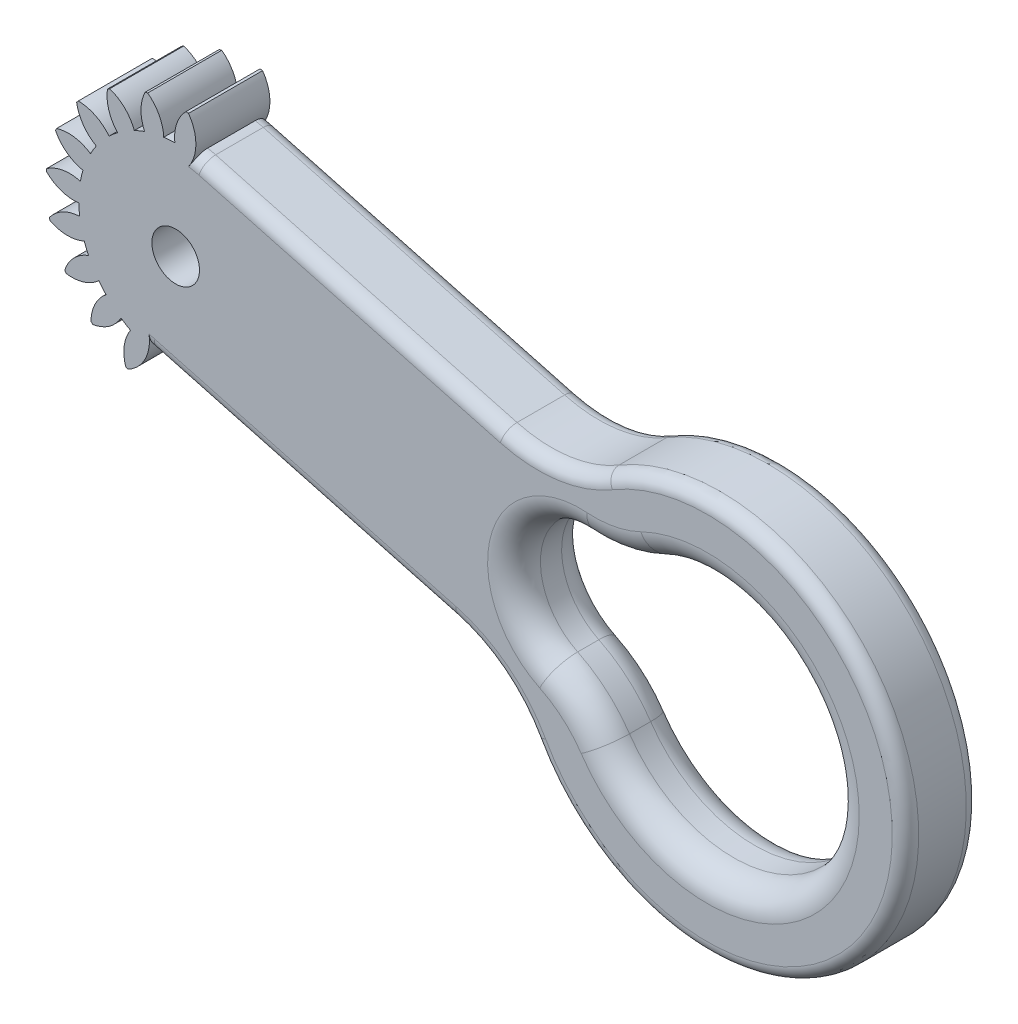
ISO-10303-21;
HEADER;
FILE_DESCRIPTION(('STEP AP214'),'2;1');
FILE_NAME('part.step','',(''),(''),'','','');
FILE_SCHEMA(('AUTOMOTIVE_DESIGN { 1 0 10303 214 1 1 1 1 }'));
ENDSEC;
DATA;
#1=APPLICATION_CONTEXT('core data for automotive mechanical design processes');
#2=APPLICATION_PROTOCOL_DEFINITION('international standard','automotive_design',2000,#1);
#3=PRODUCT_CONTEXT('',#1,'mechanical');
#4=PRODUCT('Part','Part','',(#3));
#5=PRODUCT_RELATED_PRODUCT_CATEGORY('part','',(#4));
#6=PRODUCT_DEFINITION_FORMATION('','',#4);
#7=PRODUCT_DEFINITION_CONTEXT('part definition',#1,'design');
#8=PRODUCT_DEFINITION('design','',#6,#7);
#9=PRODUCT_DEFINITION_SHAPE('','',#8);
#10=(LENGTH_UNIT() NAMED_UNIT(*) SI_UNIT(.MILLI.,.METRE.));
#11=(NAMED_UNIT(*) PLANE_ANGLE_UNIT() SI_UNIT($,.RADIAN.));
#12=(NAMED_UNIT(*) SI_UNIT($,.STERADIAN.) SOLID_ANGLE_UNIT());
#13=UNCERTAINTY_MEASURE_WITH_UNIT(LENGTH_MEASURE(1.E-05),#10,'distance_accuracy_value','');
#14=(GEOMETRIC_REPRESENTATION_CONTEXT(3) GLOBAL_UNCERTAINTY_ASSIGNED_CONTEXT((#13)) GLOBAL_UNIT_ASSIGNED_CONTEXT((#10,
#11,#12)) REPRESENTATION_CONTEXT('',''));
#15=CARTESIAN_POINT('',(0.,0.,0.));
#16=DIRECTION('',(0.,0.,1.));
#17=DIRECTION('',(1.,0.,0.));
#18=AXIS2_PLACEMENT_3D('',#15,#16,#17);
#19=CARTESIAN_POINT('',(0.,0.,5.6));
#20=DIRECTION('',(0.,0.,1.));
#21=DIRECTION('',(1.,0.,0.));
#22=AXIS2_PLACEMENT_3D('',#19,#20,#21);
#23=PLANE('',#22);
#24=CARTESIAN_POINT('',(0.,0.,5.6));
#25=DIRECTION('',(0.,0.,1.));
#26=DIRECTION('',(1.,0.,0.));
#27=AXIS2_PLACEMENT_3D('',#24,#25,#26);
#28=CIRCLE('',#27,6.425);
#29=CARTESIAN_POINT('',(1.66879699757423,6.20449366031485,5.6));
#30=VERTEX_POINT('',#29);
#31=CARTESIAN_POINT('',(0.869789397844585,6.36585354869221,5.6));
#32=VERTEX_POINT('',#31);
#33=EDGE_CURVE('E862',#30,#32,#28,.T.);
#34=ORIENTED_EDGE('',*,*,#33,.T.);
#35=CARTESIAN_POINT('',(-1.57785588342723,8.1173648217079,5.6));
#36=DIRECTION('',(0.,0.,1.));
#37=DIRECTION('',(1.,0.,0.));
#38=AXIS2_PLACEMENT_3D('',#35,#36,#37);
#39=CIRCLE('',#38,3.00977726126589);
#40=CARTESIAN_POINT('',(0.875239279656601,9.86123502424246,5.6));
#41=VERTEX_POINT('',#40);
#42=EDGE_CURVE('E57',#41,#32,#39,.F.);
#43=ORIENTED_EDGE('',*,*,#42,.F.);
#44=CARTESIAN_POINT('',(0.,0.,5.6));
#45=DIRECTION('',(0.,0.,1.));
#46=DIRECTION('',(1.,0.,0.));
#47=AXIS2_PLACEMENT_3D('',#44,#45,#46);
#48=CIRCLE('',#47,9.9);
#49=CARTESIAN_POINT('',(0.67817339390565,9.87674444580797,5.6));
#50=VERTEX_POINT('',#49);
#51=EDGE_CURVE('E690',#41,#50,#48,.T.);
#52=ORIENTED_EDGE('',*,*,#51,.T.);
#53=CARTESIAN_POINT('',(2.82826548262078,7.7705955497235,5.6));
#54=DIRECTION('',(0.,0.,1.));
#55=DIRECTION('',(1.,0.,0.));
#56=AXIS2_PLACEMENT_3D('',#53,#54,#55);
#57=CIRCLE('',#56,3.00977726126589);
#58=CARTESIAN_POINT('',(-0.161401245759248,7.42324555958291,5.6));
#59=VERTEX_POINT('',#58);
#60=EDGE_CURVE('E693',#50,#59,#57,.T.);
#61=ORIENTED_EDGE('',*,*,#60,.T.);
#62=CARTESIAN_POINT('',(0.,0.,5.6));
#63=DIRECTION('',(0.,0.,1.));
#64=DIRECTION('',(1.,0.,0.));
#65=AXIS2_PLACEMENT_3D('',#62,#63,#64);
#66=CIRCLE('',#65,7.425);
#67=CARTESIAN_POINT('',(-1.00183731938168,7.35710180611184,5.6));
#68=VERTEX_POINT('',#67);
#69=EDGE_CURVE('E713',#59,#68,#66,.T.);
#70=ORIENTED_EDGE('',*,*,#69,.T.);
#71=CARTESIAN_POINT('',(-4.00903379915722,7.23248842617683,5.6));
#72=DIRECTION('',(0.,0.,1.));
#73=DIRECTION('',(0.951056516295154,0.309016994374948,0.));
#74=AXIS2_PLACEMENT_3D('',#71,#72,#73);
#75=CIRCLE('',#74,3.00977726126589);
#76=CARTESIAN_POINT('',(-2.21488718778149,9.64905564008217,5.6));
#77=VERTEX_POINT('',#76);
#78=EDGE_CURVE('E662',#77,#68,#75,.F.);
#79=ORIENTED_EDGE('',*,*,#78,.F.);
#80=CARTESIAN_POINT('',(0.,0.,5.6));
#81=DIRECTION('',(0.,0.,1.));
#82=DIRECTION('',(0.951056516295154,0.309016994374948,0.));
#83=AXIS2_PLACEMENT_3D('',#80,#81,#82);
#84=CIRCLE('',#83,9.9);
#85=CARTESIAN_POINT('',(-2.40710065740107,9.60290926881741,5.6));
#86=VERTEX_POINT('',#85);
#87=EDGE_CURVE('E665',#77,#86,#84,.T.);
#88=ORIENTED_EDGE('',*,*,#87,.T.);
#89=CARTESIAN_POINT('',(0.288594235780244,8.26425763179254,5.6));
#90=DIRECTION('',(0.,0.,1.));
#91=DIRECTION('',(0.951056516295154,0.309016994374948,0.));
#92=AXIS2_PLACEMENT_3D('',#89,#90,#91);
#93=CIRCLE('',#92,3.00977726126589);
#94=CARTESIAN_POINT('',(-2.44741073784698,7.01005033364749,5.6));
#95=VERTEX_POINT('',#94);
#96=EDGE_CURVE('E668',#86,#95,#93,.T.);
#97=ORIENTED_EDGE('',*,*,#96,.T.);
#98=CARTESIAN_POINT('',(-3.2262733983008,6.68743485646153,5.6));
#99=VERTEX_POINT('',#98);
#100=EDGE_CURVE('E717',#95,#99,#66,.T.);
#101=ORIENTED_EDGE('',*,*,#100,.T.);
#102=CARTESIAN_POINT('',(-6.04777955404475,5.63964567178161,5.6));
#103=DIRECTION('',(0.,0.,1.));
#104=DIRECTION('',(0.809016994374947,0.587785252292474,0.));
#105=AXIS2_PLACEMENT_3D('',#102,#103,#104);
#106=CIRCLE('',#105,3.00977726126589);
#107=CARTESIAN_POINT('',(-5.08820506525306,8.49235946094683,5.6));
#108=VERTEX_POINT('',#107);
#109=EDGE_CURVE('E635',#108,#99,#106,.F.);
#110=ORIENTED_EDGE('',*,*,#109,.F.);
#111=CARTESIAN_POINT('',(0.,0.,5.6));
#112=DIRECTION('',(0.,0.,1.));
#113=DIRECTION('',(0.809016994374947,0.587785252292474,0.));
#114=AXIS2_PLACEMENT_3D('',#111,#112,#113);
#115=CIRCLE('',#114,9.9);
#116=CARTESIAN_POINT('',(-5.25675092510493,8.38907442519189,5.6));
#117=VERTEX_POINT('',#116);
#118=EDGE_CURVE('E638',#108,#117,#115,.T.);
#119=ORIENTED_EDGE('',*,*,#118,.T.);
#120=CARTESIAN_POINT('',(-2.27932662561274,7.94895659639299,5.6));
#121=DIRECTION('',(0.,0.,1.));
#122=DIRECTION('',(0.809016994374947,0.587785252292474,0.));
#123=AXIS2_PLACEMENT_3D('',#120,#121,#122);
#124=CIRCLE('',#123,3.00977726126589);
#125=CARTESIAN_POINT('',(-4.49385061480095,5.91066253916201,5.6));
#126=VERTEX_POINT('',#125);
#127=EDGE_CURVE('E641',#117,#126,#124,.T.);
#128=ORIENTED_EDGE('',*,*,#127,.T.);
#129=CARTESIAN_POINT('',(-5.13489935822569,5.36315518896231,5.6));
#130=VERTEX_POINT('',#129);
#131=EDGE_CURVE('E1808',#126,#130,#66,.T.);
#132=ORIENTED_EDGE('',*,*,#131,.T.);
#133=CARTESIAN_POINT('',(-7.4945265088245,3.49475510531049,5.6));
#134=DIRECTION('',(0.,0.,1.));
#135=DIRECTION('',(0.587785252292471,0.809016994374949,0.));
#136=AXIS2_PLACEMENT_3D('',#133,#134,#135);
#137=CIRCLE('',#136,3.00977726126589);
#138=CARTESIAN_POINT('',(-7.46345397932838,6.50437196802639,5.6));
#139=VERTEX_POINT('',#138);
#140=EDGE_CURVE('E608',#139,#130,#137,.F.);
#141=ORIENTED_EDGE('',*,*,#140,.F.);
#142=CARTESIAN_POINT('',(0.,0.,5.6));
#143=DIRECTION('',(0.,0.,1.));
#144=DIRECTION('',(0.587785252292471,0.809016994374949,0.));
#145=AXIS2_PLACEMENT_3D('',#142,#143,#144);
#146=CIRCLE('',#145,9.9);
#147=CARTESIAN_POINT('',(-7.59183378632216,6.35405852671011,5.6));
#148=VERTEX_POINT('',#147);
#149=EDGE_CURVE('E611',#139,#148,#146,.T.);
#150=ORIENTED_EDGE('',*,*,#149,.T.);
#151=CARTESIAN_POINT('',(-4.62413111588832,6.85555630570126,5.6));
#152=DIRECTION('',(0.,0.,1.));
#153=DIRECTION('',(0.587785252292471,0.809016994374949,0.));
#154=AXIS2_PLACEMENT_3D('',#151,#152,#153);
#155=CIRCLE('',#154,3.00977726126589);
#156=CARTESIAN_POINT('',(-6.10040108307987,4.23269791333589,5.6));
#157=VERTEX_POINT('',#156);
#158=EDGE_CURVE('E614',#148,#157,#155,.T.);
#159=ORIENTED_EDGE('',*,*,#158,.T.);
#160=CARTESIAN_POINT('',(-6.54088559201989,3.51389252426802,5.6));
#161=VERTEX_POINT('',#160);
#162=EDGE_CURVE('E1810',#157,#161,#66,.T.);
#163=ORIENTED_EDGE('',*,*,#162,.T.);
#164=CARTESIAN_POINT('',(-8.20765699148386,1.00777355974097,5.6));
#165=DIRECTION('',(0.,0.,1.));
#166=DIRECTION('',(0.309016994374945,0.951056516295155,0.));
#167=AXIS2_PLACEMENT_3D('',#164,#165,#166);
#168=CIRCLE('',#167,3.00977726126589);
#169=CARTESIAN_POINT('',(-9.10812801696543,3.87969122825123,5.6));
#170=VERTEX_POINT('',#169);
#171=EDGE_CURVE('E581',#170,#161,#168,.F.);
#172=ORIENTED_EDGE('',*,*,#171,.F.);
#173=CARTESIAN_POINT('',(0.,0.,5.6));
#174=DIRECTION('',(0.,0.,1.));
#175=DIRECTION('',(0.309016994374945,0.951056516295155,0.));
#176=AXIS2_PLACEMENT_3D('',#173,#174,#175);
#177=CIRCLE('',#176,9.9);
#178=CARTESIAN_POINT('',(-9.18377506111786,3.69706310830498,5.6));
#179=VERTEX_POINT('',#178);
#180=EDGE_CURVE('E584',#170,#179,#177,.T.);
#181=ORIENTED_EDGE('',*,*,#180,.T.);
#182=CARTESIAN_POINT('',(-6.51629343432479,5.09108639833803,5.6));
#183=DIRECTION('',(0.,0.,1.));
#184=DIRECTION('',(0.309016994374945,0.951056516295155,0.));
#185=AXIS2_PLACEMENT_3D('',#182,#183,#184);
#186=CIRCLE('',#185,3.00977726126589);
#187=CARTESIAN_POINT('',(-7.10980178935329,2.14040732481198,5.6));
#188=VERTEX_POINT('',#187);
#189=EDGE_CURVE('E587',#179,#188,#186,.T.);
#190=ORIENTED_EDGE('',*,*,#189,.T.);
#191=CARTESIAN_POINT('',(-7.3066043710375,1.32066557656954,5.6));
#192=VERTEX_POINT('',#191);
#193=EDGE_CURVE('E1812',#188,#192,#66,.T.);
#194=ORIENTED_EDGE('',*,*,#193,.T.);
#195=CARTESIAN_POINT('',(-8.11736482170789,-1.57785588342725,5.6));
#196=DIRECTION('',(0.,0.,1.));
#197=DIRECTION('',(0.,1.,0.));
#198=AXIS2_PLACEMENT_3D('',#195,#196,#197);
#199=CIRCLE('',#198,3.00977726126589);
#200=CARTESIAN_POINT('',(-9.86123502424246,0.875239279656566,5.6));
#201=VERTEX_POINT('',#200);
#202=EDGE_CURVE('E554',#201,#192,#199,.F.);
#203=ORIENTED_EDGE('',*,*,#202,.F.);
#204=CARTESIAN_POINT('',(0.,0.,5.6));
#205=DIRECTION('',(0.,0.,1.));
#206=DIRECTION('',(0.,1.,0.));
#207=AXIS2_PLACEMENT_3D('',#204,#205,#206);
#208=CIRCLE('',#207,9.9);
#209=CARTESIAN_POINT('',(-9.87674444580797,0.678173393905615,5.6));
#210=VERTEX_POINT('',#209);
#211=EDGE_CURVE('E557',#201,#210,#208,.T.);
#212=ORIENTED_EDGE('',*,*,#211,.T.);
#213=CARTESIAN_POINT('',(-7.77059554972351,2.82826548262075,5.6));
#214=DIRECTION('',(0.,0.,1.));
#215=DIRECTION('',(0.,1.,0.));
#216=AXIS2_PLACEMENT_3D('',#213,#214,#215);
#217=CIRCLE('',#216,3.00977726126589);
#218=CARTESIAN_POINT('',(-7.42324555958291,-0.161401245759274,5.6));
#219=VERTEX_POINT('',#218);
#220=EDGE_CURVE('E560',#210,#219,#217,.T.);
#221=ORIENTED_EDGE('',*,*,#220,.T.);
#222=CARTESIAN_POINT('',(-7.35710180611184,-1.00183731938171,5.6));
#223=VERTEX_POINT('',#222);
#224=EDGE_CURVE('E1815',#219,#223,#66,.T.);
#225=ORIENTED_EDGE('',*,*,#224,.T.);
#226=CARTESIAN_POINT('',(-7.23248842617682,-4.00903379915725,5.6));
#227=DIRECTION('',(0.,0.,1.));
#228=DIRECTION('',(-0.309016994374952,0.951056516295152,0.));
#229=AXIS2_PLACEMENT_3D('',#226,#227,#228);
#230=CIRCLE('',#229,3.00977726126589);
#231=CARTESIAN_POINT('',(-9.64905564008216,-2.21488718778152,5.6));
#232=VERTEX_POINT('',#231);
#233=EDGE_CURVE('E527',#232,#223,#230,.F.);
#234=ORIENTED_EDGE('',*,*,#233,.F.);
#235=CARTESIAN_POINT('',(0.,0.,5.6));
#236=DIRECTION('',(0.,0.,1.));
#237=DIRECTION('',(-0.309016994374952,0.951056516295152,0.));
#238=AXIS2_PLACEMENT_3D('',#235,#236,#237);
#239=CIRCLE('',#238,9.9);
#240=CARTESIAN_POINT('',(-9.6029092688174,-2.40710065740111,5.6));
#241=VERTEX_POINT('',#240);
#242=EDGE_CURVE('E530',#232,#241,#239,.T.);
#243=ORIENTED_EDGE('',*,*,#242,.T.);
#244=CARTESIAN_POINT('',(-8.26425763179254,0.288594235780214,5.6));
#245=DIRECTION('',(0.,0.,1.));
#246=DIRECTION('',(-0.309016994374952,0.951056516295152,0.));
#247=AXIS2_PLACEMENT_3D('',#244,#245,#246);
#248=CIRCLE('',#247,3.00977726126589);
#249=CARTESIAN_POINT('',(-7.01005033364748,-2.447410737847,5.6));
#250=VERTEX_POINT('',#249);
#251=EDGE_CURVE('E533',#241,#250,#248,.T.);
#252=ORIENTED_EDGE('',*,*,#251,.T.);
#253=CARTESIAN_POINT('',(-6.68743485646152,-3.22627339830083,5.6));
#254=VERTEX_POINT('',#253);
#255=EDGE_CURVE('E1818',#250,#254,#66,.T.);
#256=ORIENTED_EDGE('',*,*,#255,.T.);
#257=CARTESIAN_POINT('',(-5.63964567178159,-6.04777955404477,5.6));
#258=DIRECTION('',(0.,0.,1.));
#259=DIRECTION('',(-0.587785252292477,0.809016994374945,0.));
#260=AXIS2_PLACEMENT_3D('',#257,#258,#259);
#261=CIRCLE('',#260,3.00977726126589);
#262=CARTESIAN_POINT('',(-8.49235946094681,-5.08820506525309,5.6));
#263=VERTEX_POINT('',#262);
#264=EDGE_CURVE('E500',#263,#254,#261,.F.);
#265=ORIENTED_EDGE('',*,*,#264,.F.);
#266=CARTESIAN_POINT('',(0.,0.,5.6));
#267=DIRECTION('',(0.,0.,1.));
#268=DIRECTION('',(-0.587785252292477,0.809016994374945,0.));
#269=AXIS2_PLACEMENT_3D('',#266,#267,#268);
#270=CIRCLE('',#269,9.9);
#271=CARTESIAN_POINT('',(-8.38907442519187,-5.25675092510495,5.6));
#272=VERTEX_POINT('',#271);
#273=EDGE_CURVE('E503',#263,#272,#270,.T.);
#274=ORIENTED_EDGE('',*,*,#273,.T.);
#275=CARTESIAN_POINT('',(-7.94895659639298,-2.27932662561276,5.6));
#276=DIRECTION('',(0.,0.,1.));
#277=DIRECTION('',(-0.587785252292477,0.809016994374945,0.));
#278=AXIS2_PLACEMENT_3D('',#275,#276,#277);
#279=CIRCLE('',#278,3.00977726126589);
#280=CARTESIAN_POINT('',(-5.910662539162,-4.49385061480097,5.6));
#281=VERTEX_POINT('',#280);
#282=EDGE_CURVE('E506',#272,#281,#279,.T.);
#283=ORIENTED_EDGE('',*,*,#282,.T.);
#284=CARTESIAN_POINT('',(-5.3631551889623,-5.13489935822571,5.6));
#285=VERTEX_POINT('',#284);
#286=EDGE_CURVE('E1821',#281,#285,#66,.T.);
#287=ORIENTED_EDGE('',*,*,#286,.T.);
#288=CARTESIAN_POINT('',(-3.49475510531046,-7.49452650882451,5.6));
#289=DIRECTION('',(0.,0.,1.));
#290=DIRECTION('',(-0.809016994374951,0.587785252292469,0.));
#291=AXIS2_PLACEMENT_3D('',#288,#289,#290);
#292=CIRCLE('',#291,3.00977726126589);
#293=CARTESIAN_POINT('',(-6.50437196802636,-7.4634539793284,5.6));
#294=VERTEX_POINT('',#293);
#295=EDGE_CURVE('E474',#294,#285,#292,.F.);
#296=ORIENTED_EDGE('',*,*,#295,.F.);
#297=CARTESIAN_POINT('',(0.,0.,5.6));
#298=DIRECTION('',(0.,0.,1.));
#299=DIRECTION('',(-0.809016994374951,0.587785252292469,0.));
#300=AXIS2_PLACEMENT_3D('',#297,#298,#299);
#301=CIRCLE('',#300,9.9);
#302=CARTESIAN_POINT('',(-6.35405852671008,-7.59183378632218,5.6));
#303=VERTEX_POINT('',#302);
#304=EDGE_CURVE('E477',#294,#303,#301,.T.);
#305=ORIENTED_EDGE('',*,*,#304,.T.);
#306=CARTESIAN_POINT('',(-6.85555630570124,-4.62413111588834,5.6));
#307=DIRECTION('',(0.,0.,1.));
#308=DIRECTION('',(-0.809016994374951,0.587785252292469,0.));
#309=AXIS2_PLACEMENT_3D('',#306,#307,#308);
#310=CIRCLE('',#309,3.00977726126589);
#311=CARTESIAN_POINT('',(-4.23269791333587,-6.10040108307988,5.6));
#312=VERTEX_POINT('',#311);
#313=EDGE_CURVE('E480',#303,#312,#310,.T.);
#314=ORIENTED_EDGE('',*,*,#313,.T.);
#315=CARTESIAN_POINT('',(-3.513892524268,-6.5408855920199,5.6));
#316=VERTEX_POINT('',#315);
#317=EDGE_CURVE('E455',#312,#316,#66,.T.);
#318=ORIENTED_EDGE('',*,*,#317,.T.);
#319=CARTESIAN_POINT('',(-1.00777355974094,-8.20765699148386,5.6));
#320=DIRECTION('',(0.,0.,1.));
#321=DIRECTION('',(-0.951056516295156,0.309016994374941,0.));
#322=AXIS2_PLACEMENT_3D('',#319,#320,#321);
#323=CIRCLE('',#322,3.00977726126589);
#324=CARTESIAN_POINT('',(-3.87969122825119,-9.10812801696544,5.6));
#325=VERTEX_POINT('',#324);
#326=EDGE_CURVE('E437',#325,#316,#323,.F.);
#327=ORIENTED_EDGE('',*,*,#326,.F.);
#328=CARTESIAN_POINT('',(0.,0.,5.6));
#329=DIRECTION('',(0.,0.,1.));
#330=DIRECTION('',(-0.951056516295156,0.309016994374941,0.));
#331=AXIS2_PLACEMENT_3D('',#328,#329,#330);
#332=CIRCLE('',#331,9.9);
#333=CARTESIAN_POINT('',(-3.69706310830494,-9.18377506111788,5.6));
#334=VERTEX_POINT('',#333);
#335=EDGE_CURVE('E446',#325,#334,#332,.T.);
#336=ORIENTED_EDGE('',*,*,#335,.T.);
#337=CARTESIAN_POINT('',(-5.091086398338,-6.51629343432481,5.6));
#338=DIRECTION('',(0.,0.,1.));
#339=DIRECTION('',(-0.951056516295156,0.309016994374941,0.));
#340=AXIS2_PLACEMENT_3D('',#337,#338,#339);
#341=CIRCLE('',#340,3.00977726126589);
#342=CARTESIAN_POINT('',(-2.11504900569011,-6.06689316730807,5.6));
#343=VERTEX_POINT('',#342);
#344=EDGE_CURVE('E450',#334,#343,#341,.T.);
#345=ORIENTED_EDGE('',*,*,#344,.T.);
#346=CARTESIAN_POINT('',(0.,0.,5.6));
#347=DIRECTION('',(0.,0.,1.));
#348=DIRECTION('',(1.,0.,0.));
#349=AXIS2_PLACEMENT_3D('',#346,#347,#348);
#350=CIRCLE('',#349,6.425);
#351=CARTESIAN_POINT('',(-1.66879699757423,-6.20449366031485,5.6));
#352=VERTEX_POINT('',#351);
#353=EDGE_CURVE('E857',#343,#352,#350,.T.);
#354=ORIENTED_EDGE('',*,*,#353,.T.);
#355=DIRECTION('',(0.965679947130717,-0.25973494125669,0.));
#356=VECTOR('',#355,1.);
#357=CARTESIAN_POINT('',(-1.66879699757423,-6.20449366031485,5.6));
#358=LINE('',#357,#356);
#359=CARTESIAN_POINT('',(21.1276391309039,-12.3359567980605,5.6));
#360=VERTEX_POINT('',#359);
#361=EDGE_CURVE('E855',#352,#360,#358,.T.);
#362=ORIENTED_EDGE('',*,*,#361,.T.);
#363=CARTESIAN_POINT('',(18.2705547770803,-22.9584362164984,5.6));
#364=DIRECTION('',(0.,0.,1.));
#365=DIRECTION('',(1.,0.,0.));
#366=AXIS2_PLACEMENT_3D('',#363,#364,#365);
#367=CIRCLE('',#366,11.);
#368=CARTESIAN_POINT('',(27.8790158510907,-17.6033007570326,5.6));
#369=VERTEX_POINT('',#368);
#370=EDGE_CURVE('E853',#360,#369,#367,.F.);
#371=ORIENTED_EDGE('',*,*,#370,.T.);
#372=CARTESIAN_POINT('',(40.1079663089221,-10.7876738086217,5.6));
#373=DIRECTION('',(0.,0.,1.));
#374=DIRECTION('',(1.,0.,0.));
#375=AXIS2_PLACEMENT_3D('',#372,#373,#374);
#376=CIRCLE('',#375,14.);
#377=CARTESIAN_POINT('',(32.9480029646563,1.24290909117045,5.6));
#378=VERTEX_POINT('',#377);
#379=EDGE_CURVE('E851',#369,#378,#376,.T.);
#380=ORIENTED_EDGE('',*,*,#379,.T.);
#381=CARTESIAN_POINT('',(27.322317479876,10.6955099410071,5.6));
#382=DIRECTION('',(0.,0.,1.));
#383=DIRECTION('',(1.,0.,0.));
#384=AXIS2_PLACEMENT_3D('',#381,#382,#383);
#385=CIRCLE('',#384,11.);
#386=CARTESIAN_POINT('',(24.4652331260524,0.0730305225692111,5.6));
#387=VERTEX_POINT('',#386);
#388=EDGE_CURVE('E859',#378,#387,#385,.F.);
#389=ORIENTED_EDGE('',*,*,#388,.T.);
#390=DIRECTION('',(-0.965679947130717,0.25973494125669,0.));
#391=VECTOR('',#390,1.);
#392=CARTESIAN_POINT('',(1.66879699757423,6.20449366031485,5.6));
#393=LINE('',#392,#391);
#394=EDGE_CURVE('E65',#387,#30,#393,.T.);
#395=ORIENTED_EDGE('',*,*,#394,.T.);
#396=EDGE_LOOP('',(#34,#43,#52,#61,#70,#79,#88,#97,#101,#110,#119,#128,#132,#141,#150,#159,#163,
#172,#181,#190,#194,#203,#212,#221,#225,#234,#243,#252,#256,#265,#274,#283,#287,#296,#305,#314,
#318,#327,#336,#345,#354,#362,#371,#380,#389,#395));
#397=FACE_BOUND('',#396,.T.);
#398=CARTESIAN_POINT('',(-0.0975437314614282,0.,5.6));
#399=DIRECTION('',(0.,0.,1.));
#400=DIRECTION('',(1.,0.,0.));
#401=AXIS2_PLACEMENT_3D('',#398,#399,#400);
#402=CIRCLE('',#401,1.8);
#403=CARTESIAN_POINT('',(1.70245626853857,0.,5.6));
#404=VERTEX_POINT('',#403);
#405=EDGE_CURVE('E760',#404,#404,#402,.T.);
#406=ORIENTED_EDGE('',*,*,#405,.F.);
#407=EDGE_LOOP('',(#406));
#408=FACE_BOUND('',#407,.T.);
#409=CARTESIAN_POINT('',(23.9444441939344,-21.6959529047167,5.6));
#410=DIRECTION('',(0.,0.,1.));
#411=DIRECTION('',(1.,0.,0.));
#412=AXIS2_PLACEMENT_3D('',#409,#410,#411);
#413=CIRCLE('',#412,8.);
#414=CARTESIAN_POINT('',(27.4386700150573,-14.4993991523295,5.6));
#415=VERTEX_POINT('',#414);
#416=CARTESIAN_POINT('',(30.5756327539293,-17.2207614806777,5.6));
#417=VERTEX_POINT('',#416);
#418=EDGE_CURVE('E777',#415,#417,#413,.F.);
#419=ORIENTED_EDGE('',*,*,#418,.F.);
#420=CARTESIAN_POINT('',(30.4961176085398,-8.20241461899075,5.6));
#421=DIRECTION('',(0.,0.,1.));
#422=DIRECTION('',(1.,0.,0.));
#423=AXIS2_PLACEMENT_3D('',#420,#421,#422);
#424=CIRCLE('',#423,7.);
#425=CARTESIAN_POINT('',(31.0100242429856,-1.22130439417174,5.6));
#426=VERTEX_POINT('',#425);
#427=EDGE_CURVE('E741',#415,#426,#424,.F.);
#428=ORIENTED_EDGE('',*,*,#427,.T.);
#429=CARTESIAN_POINT('',(31.5973461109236,6.75710729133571,5.6));
#430=DIRECTION('',(0.,0.,1.));
#431=DIRECTION('',(1.,0.,0.));
#432=AXIS2_PLACEMENT_3D('',#429,#430,#431);
#433=CIRCLE('',#432,8.);
#434=CARTESIAN_POINT('',(35.0888826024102,-0.440751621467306,5.6));
#435=VERTEX_POINT('',#434);
#436=EDGE_CURVE('E774',#435,#426,#433,.F.);
#437=ORIENTED_EDGE('',*,*,#436,.F.);
#438=CARTESIAN_POINT('',(40.1079663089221,-10.7876738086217,5.6));
#439=DIRECTION('',(0.,0.,1.));
#440=DIRECTION('',(1.,0.,0.));
#441=AXIS2_PLACEMENT_3D('',#438,#439,#440);
#442=CIRCLE('',#441,11.5);
#443=EDGE_CURVE('E738',#435,#417,#442,.F.);
#444=ORIENTED_EDGE('',*,*,#443,.T.);
#445=EDGE_LOOP('',(#419,#428,#437,#444));
#446=FACE_BOUND('',#445,.T.);
#447=ADVANCED_FACE('F39',(#397,#408,#446),#23,.T.);
#448=CARTESIAN_POINT('',(0.,0.,0.));
#449=DIRECTION('',(0.,0.,1.));
#450=DIRECTION('',(1.,0.,0.));
#451=AXIS2_PLACEMENT_3D('',#448,#449,#450);
#452=PLANE('',#451);
#453=CARTESIAN_POINT('',(-0.0975437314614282,0.,0.));
#454=DIRECTION('',(0.,0.,-1.));
#455=DIRECTION('',(-1.,0.,0.));
#456=AXIS2_PLACEMENT_3D('',#453,#454,#455);
#457=CIRCLE('',#456,2.3);
#458=CARTESIAN_POINT('',(-2.39754373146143,0.,0.));
#459=VERTEX_POINT('',#458);
#460=EDGE_CURVE('E805',#459,#459,#457,.T.);
#461=ORIENTED_EDGE('',*,*,#460,.F.);
#462=EDGE_LOOP('',(#461));
#463=FACE_BOUND('',#462,.T.);
#464=CARTESIAN_POINT('',(0.,0.,0.));
#465=DIRECTION('',(0.,0.,1.));
#466=DIRECTION('',(1.,0.,0.));
#467=AXIS2_PLACEMENT_3D('',#464,#465,#466);
#468=CIRCLE('',#467,6.425);
#469=CARTESIAN_POINT('',(-1.66879699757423,-6.20449366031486,0.));
#470=VERTEX_POINT('',#469);
#471=CARTESIAN_POINT('',(-2.11504900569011,-6.06689316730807,0.));
#472=VERTEX_POINT('',#471);
#473=EDGE_CURVE('E822',#470,#472,#468,.F.);
#474=ORIENTED_EDGE('',*,*,#473,.T.);
#475=CARTESIAN_POINT('',(-5.091086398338,-6.51629343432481,0.));
#476=DIRECTION('',(0.,0.,1.));
#477=DIRECTION('',(-0.951056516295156,0.309016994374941,0.));
#478=AXIS2_PLACEMENT_3D('',#475,#476,#477);
#479=CIRCLE('',#478,3.00977726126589);
#480=CARTESIAN_POINT('',(-3.69706310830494,-9.18377506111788,0.));
#481=VERTEX_POINT('',#480);
#482=EDGE_CURVE('E456',#481,#472,#479,.T.);
#483=ORIENTED_EDGE('',*,*,#482,.F.);
#484=CARTESIAN_POINT('',(0.,0.,0.));
#485=DIRECTION('',(0.,0.,1.));
#486=DIRECTION('',(-0.951056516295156,0.309016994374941,0.));
#487=AXIS2_PLACEMENT_3D('',#484,#485,#486);
#488=CIRCLE('',#487,9.9);
#489=CARTESIAN_POINT('',(-3.87969122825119,-9.10812801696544,0.));
#490=VERTEX_POINT('',#489);
#491=EDGE_CURVE('E458',#490,#481,#488,.T.);
#492=ORIENTED_EDGE('',*,*,#491,.F.);
#493=CARTESIAN_POINT('',(-1.00777355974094,-8.20765699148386,0.));
#494=DIRECTION('',(0.,0.,1.));
#495=DIRECTION('',(-0.951056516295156,0.309016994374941,0.));
#496=AXIS2_PLACEMENT_3D('',#493,#494,#495);
#497=CIRCLE('',#496,3.00977726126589);
#498=CARTESIAN_POINT('',(-3.513892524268,-6.5408855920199,0.));
#499=VERTEX_POINT('',#498);
#500=EDGE_CURVE('E439',#490,#499,#497,.F.);
#501=ORIENTED_EDGE('',*,*,#500,.T.);
#502=CARTESIAN_POINT('',(0.,0.,0.));
#503=DIRECTION('',(0.,0.,1.));
#504=DIRECTION('',(1.,0.,0.));
#505=AXIS2_PLACEMENT_3D('',#502,#503,#504);
#506=CIRCLE('',#505,7.425);
#507=CARTESIAN_POINT('',(-4.23269791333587,-6.10040108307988,0.));
#508=VERTEX_POINT('',#507);
#509=EDGE_CURVE('E712',#508,#499,#506,.T.);
#510=ORIENTED_EDGE('',*,*,#509,.F.);
#511=CARTESIAN_POINT('',(-6.85555630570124,-4.62413111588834,0.));
#512=DIRECTION('',(0.,0.,1.));
#513=DIRECTION('',(-0.809016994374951,0.587785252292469,0.));
#514=AXIS2_PLACEMENT_3D('',#511,#512,#513);
#515=CIRCLE('',#514,3.00977726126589);
#516=CARTESIAN_POINT('',(-6.35405852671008,-7.59183378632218,0.));
#517=VERTEX_POINT('',#516);
#518=EDGE_CURVE('E478',#517,#508,#515,.T.);
#519=ORIENTED_EDGE('',*,*,#518,.F.);
#520=CARTESIAN_POINT('',(0.,0.,0.));
#521=DIRECTION('',(0.,0.,1.));
#522=DIRECTION('',(-0.809016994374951,0.587785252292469,0.));
#523=AXIS2_PLACEMENT_3D('',#520,#521,#522);
#524=CIRCLE('',#523,9.9);
#525=CARTESIAN_POINT('',(-6.50437196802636,-7.4634539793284,0.));
#526=VERTEX_POINT('',#525);
#527=EDGE_CURVE('E485',#526,#517,#524,.T.);
#528=ORIENTED_EDGE('',*,*,#527,.F.);
#529=CARTESIAN_POINT('',(-3.49475510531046,-7.49452650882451,0.));
#530=DIRECTION('',(0.,0.,1.));
#531=DIRECTION('',(-0.809016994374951,0.587785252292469,0.));
#532=AXIS2_PLACEMENT_3D('',#529,#530,#531);
#533=CIRCLE('',#532,3.00977726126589);
#534=CARTESIAN_POINT('',(-5.3631551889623,-5.13489935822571,0.));
#535=VERTEX_POINT('',#534);
#536=EDGE_CURVE('E442',#526,#535,#533,.F.);
#537=ORIENTED_EDGE('',*,*,#536,.T.);
#538=CARTESIAN_POINT('',(-5.910662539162,-4.49385061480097,0.));
#539=VERTEX_POINT('',#538);
#540=EDGE_CURVE('E1788',#539,#535,#506,.T.);
#541=ORIENTED_EDGE('',*,*,#540,.F.);
#542=CARTESIAN_POINT('',(-7.94895659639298,-2.27932662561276,0.));
#543=DIRECTION('',(0.,0.,1.));
#544=DIRECTION('',(-0.587785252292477,0.809016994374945,0.));
#545=AXIS2_PLACEMENT_3D('',#542,#543,#544);
#546=CIRCLE('',#545,3.00977726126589);
#547=CARTESIAN_POINT('',(-8.38907442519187,-5.25675092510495,0.));
#548=VERTEX_POINT('',#547);
#549=EDGE_CURVE('E504',#548,#539,#546,.T.);
#550=ORIENTED_EDGE('',*,*,#549,.F.);
#551=CARTESIAN_POINT('',(0.,0.,0.));
#552=DIRECTION('',(0.,0.,1.));
#553=DIRECTION('',(-0.587785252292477,0.809016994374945,0.));
#554=AXIS2_PLACEMENT_3D('',#551,#552,#553);
#555=CIRCLE('',#554,9.9);
#556=CARTESIAN_POINT('',(-8.49235946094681,-5.08820506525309,0.));
#557=VERTEX_POINT('',#556);
#558=EDGE_CURVE('E512',#557,#548,#555,.T.);
#559=ORIENTED_EDGE('',*,*,#558,.F.);
#560=CARTESIAN_POINT('',(-5.63964567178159,-6.04777955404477,0.));
#561=DIRECTION('',(0.,0.,1.));
#562=DIRECTION('',(-0.587785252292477,0.809016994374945,0.));
#563=AXIS2_PLACEMENT_3D('',#560,#561,#562);
#564=CIRCLE('',#563,3.00977726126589);
#565=CARTESIAN_POINT('',(-6.68743485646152,-3.22627339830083,0.));
#566=VERTEX_POINT('',#565);
#567=EDGE_CURVE('E499',#557,#566,#564,.F.);
#568=ORIENTED_EDGE('',*,*,#567,.T.);
#569=CARTESIAN_POINT('',(-7.01005033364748,-2.447410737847,0.));
#570=VERTEX_POINT('',#569);
#571=EDGE_CURVE('E1790',#570,#566,#506,.T.);
#572=ORIENTED_EDGE('',*,*,#571,.F.);
#573=CARTESIAN_POINT('',(-8.26425763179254,0.288594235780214,0.));
#574=DIRECTION('',(0.,0.,1.));
#575=DIRECTION('',(-0.309016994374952,0.951056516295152,0.));
#576=AXIS2_PLACEMENT_3D('',#573,#574,#575);
#577=CIRCLE('',#576,3.00977726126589);
#578=CARTESIAN_POINT('',(-9.6029092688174,-2.40710065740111,0.));
#579=VERTEX_POINT('',#578);
#580=EDGE_CURVE('E531',#579,#570,#577,.T.);
#581=ORIENTED_EDGE('',*,*,#580,.F.);
#582=CARTESIAN_POINT('',(0.,0.,0.));
#583=DIRECTION('',(0.,0.,1.));
#584=DIRECTION('',(-0.309016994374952,0.951056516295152,0.));
#585=AXIS2_PLACEMENT_3D('',#582,#583,#584);
#586=CIRCLE('',#585,9.9);
#587=CARTESIAN_POINT('',(-9.64905564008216,-2.21488718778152,0.));
#588=VERTEX_POINT('',#587);
#589=EDGE_CURVE('E539',#588,#579,#586,.T.);
#590=ORIENTED_EDGE('',*,*,#589,.F.);
#591=CARTESIAN_POINT('',(-7.23248842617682,-4.00903379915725,0.));
#592=DIRECTION('',(0.,0.,1.));
#593=DIRECTION('',(-0.309016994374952,0.951056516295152,0.));
#594=AXIS2_PLACEMENT_3D('',#591,#592,#593);
#595=CIRCLE('',#594,3.00977726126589);
#596=CARTESIAN_POINT('',(-7.35710180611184,-1.00183731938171,0.));
#597=VERTEX_POINT('',#596);
#598=EDGE_CURVE('E526',#588,#597,#595,.F.);
#599=ORIENTED_EDGE('',*,*,#598,.T.);
#600=CARTESIAN_POINT('',(-7.42324555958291,-0.161401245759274,0.));
#601=VERTEX_POINT('',#600);
#602=EDGE_CURVE('E1791',#601,#597,#506,.T.);
#603=ORIENTED_EDGE('',*,*,#602,.F.);
#604=CARTESIAN_POINT('',(-7.77059554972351,2.82826548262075,0.));
#605=DIRECTION('',(0.,0.,1.));
#606=DIRECTION('',(0.,1.,0.));
#607=AXIS2_PLACEMENT_3D('',#604,#605,#606);
#608=CIRCLE('',#607,3.00977726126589);
#609=CARTESIAN_POINT('',(-9.87674444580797,0.678173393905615,0.));
#610=VERTEX_POINT('',#609);
#611=EDGE_CURVE('E558',#610,#601,#608,.T.);
#612=ORIENTED_EDGE('',*,*,#611,.F.);
#613=CARTESIAN_POINT('',(0.,0.,0.));
#614=DIRECTION('',(0.,0.,1.));
#615=DIRECTION('',(0.,1.,0.));
#616=AXIS2_PLACEMENT_3D('',#613,#614,#615);
#617=CIRCLE('',#616,9.9);
#618=CARTESIAN_POINT('',(-9.86123502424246,0.875239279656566,0.));
#619=VERTEX_POINT('',#618);
#620=EDGE_CURVE('E566',#619,#610,#617,.T.);
#621=ORIENTED_EDGE('',*,*,#620,.F.);
#622=CARTESIAN_POINT('',(-8.11736482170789,-1.57785588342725,0.));
#623=DIRECTION('',(0.,0.,1.));
#624=DIRECTION('',(0.,1.,0.));
#625=AXIS2_PLACEMENT_3D('',#622,#623,#624);
#626=CIRCLE('',#625,3.00977726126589);
#627=CARTESIAN_POINT('',(-7.3066043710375,1.32066557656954,0.));
#628=VERTEX_POINT('',#627);
#629=EDGE_CURVE('E553',#619,#628,#626,.F.);
#630=ORIENTED_EDGE('',*,*,#629,.T.);
#631=CARTESIAN_POINT('',(-7.10980178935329,2.14040732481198,0.));
#632=VERTEX_POINT('',#631);
#633=EDGE_CURVE('E1792',#632,#628,#506,.T.);
#634=ORIENTED_EDGE('',*,*,#633,.F.);
#635=CARTESIAN_POINT('',(-6.51629343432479,5.09108639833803,0.));
#636=DIRECTION('',(0.,0.,1.));
#637=DIRECTION('',(0.309016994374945,0.951056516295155,0.));
#638=AXIS2_PLACEMENT_3D('',#635,#636,#637);
#639=CIRCLE('',#638,3.00977726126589);
#640=CARTESIAN_POINT('',(-9.18377506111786,3.69706310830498,0.));
#641=VERTEX_POINT('',#640);
#642=EDGE_CURVE('E585',#641,#632,#639,.T.);
#643=ORIENTED_EDGE('',*,*,#642,.F.);
#644=CARTESIAN_POINT('',(0.,0.,0.));
#645=DIRECTION('',(0.,0.,1.));
#646=DIRECTION('',(0.309016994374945,0.951056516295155,0.));
#647=AXIS2_PLACEMENT_3D('',#644,#645,#646);
#648=CIRCLE('',#647,9.9);
#649=CARTESIAN_POINT('',(-9.10812801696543,3.87969122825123,0.));
#650=VERTEX_POINT('',#649);
#651=EDGE_CURVE('E593',#650,#641,#648,.T.);
#652=ORIENTED_EDGE('',*,*,#651,.F.);
#653=CARTESIAN_POINT('',(-8.20765699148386,1.00777355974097,0.));
#654=DIRECTION('',(0.,0.,1.));
#655=DIRECTION('',(0.309016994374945,0.951056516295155,0.));
#656=AXIS2_PLACEMENT_3D('',#653,#654,#655);
#657=CIRCLE('',#656,3.00977726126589);
#658=CARTESIAN_POINT('',(-6.54088559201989,3.51389252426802,0.));
#659=VERTEX_POINT('',#658);
#660=EDGE_CURVE('E580',#650,#659,#657,.F.);
#661=ORIENTED_EDGE('',*,*,#660,.T.);
#662=CARTESIAN_POINT('',(-6.10040108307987,4.23269791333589,0.));
#663=VERTEX_POINT('',#662);
#664=EDGE_CURVE('E1793',#663,#659,#506,.T.);
#665=ORIENTED_EDGE('',*,*,#664,.F.);
#666=CARTESIAN_POINT('',(-4.62413111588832,6.85555630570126,0.));
#667=DIRECTION('',(0.,0.,1.));
#668=DIRECTION('',(0.587785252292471,0.809016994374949,0.));
#669=AXIS2_PLACEMENT_3D('',#666,#667,#668);
#670=CIRCLE('',#669,3.00977726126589);
#671=CARTESIAN_POINT('',(-7.59183378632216,6.35405852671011,0.));
#672=VERTEX_POINT('',#671);
#673=EDGE_CURVE('E612',#672,#663,#670,.T.);
#674=ORIENTED_EDGE('',*,*,#673,.F.);
#675=CARTESIAN_POINT('',(0.,0.,0.));
#676=DIRECTION('',(0.,0.,1.));
#677=DIRECTION('',(0.587785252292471,0.809016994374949,0.));
#678=AXIS2_PLACEMENT_3D('',#675,#676,#677);
#679=CIRCLE('',#678,9.9);
#680=CARTESIAN_POINT('',(-7.46345397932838,6.50437196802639,0.));
#681=VERTEX_POINT('',#680);
#682=EDGE_CURVE('E620',#681,#672,#679,.T.);
#683=ORIENTED_EDGE('',*,*,#682,.F.);
#684=CARTESIAN_POINT('',(-7.4945265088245,3.49475510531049,0.));
#685=DIRECTION('',(0.,0.,1.));
#686=DIRECTION('',(0.587785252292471,0.809016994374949,0.));
#687=AXIS2_PLACEMENT_3D('',#684,#685,#686);
#688=CIRCLE('',#687,3.00977726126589);
#689=CARTESIAN_POINT('',(-5.13489935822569,5.36315518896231,0.));
#690=VERTEX_POINT('',#689);
#691=EDGE_CURVE('E607',#681,#690,#688,.F.);
#692=ORIENTED_EDGE('',*,*,#691,.T.);
#693=CARTESIAN_POINT('',(-4.49385061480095,5.91066253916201,0.));
#694=VERTEX_POINT('',#693);
#695=EDGE_CURVE('E1794',#694,#690,#506,.T.);
#696=ORIENTED_EDGE('',*,*,#695,.F.);
#697=CARTESIAN_POINT('',(-2.27932662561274,7.94895659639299,0.));
#698=DIRECTION('',(0.,0.,1.));
#699=DIRECTION('',(0.809016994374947,0.587785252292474,0.));
#700=AXIS2_PLACEMENT_3D('',#697,#698,#699);
#701=CIRCLE('',#700,3.00977726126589);
#702=CARTESIAN_POINT('',(-5.25675092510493,8.38907442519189,0.));
#703=VERTEX_POINT('',#702);
#704=EDGE_CURVE('E639',#703,#694,#701,.T.);
#705=ORIENTED_EDGE('',*,*,#704,.F.);
#706=CARTESIAN_POINT('',(0.,0.,0.));
#707=DIRECTION('',(0.,0.,1.));
#708=DIRECTION('',(0.809016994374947,0.587785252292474,0.));
#709=AXIS2_PLACEMENT_3D('',#706,#707,#708);
#710=CIRCLE('',#709,9.9);
#711=CARTESIAN_POINT('',(-5.08820506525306,8.49235946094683,0.));
#712=VERTEX_POINT('',#711);
#713=EDGE_CURVE('E647',#712,#703,#710,.T.);
#714=ORIENTED_EDGE('',*,*,#713,.F.);
#715=CARTESIAN_POINT('',(-6.04777955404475,5.63964567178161,0.));
#716=DIRECTION('',(0.,0.,1.));
#717=DIRECTION('',(0.809016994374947,0.587785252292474,0.));
#718=AXIS2_PLACEMENT_3D('',#715,#716,#717);
#719=CIRCLE('',#718,3.00977726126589);
#720=CARTESIAN_POINT('',(-3.2262733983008,6.68743485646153,0.));
#721=VERTEX_POINT('',#720);
#722=EDGE_CURVE('E634',#712,#721,#719,.F.);
#723=ORIENTED_EDGE('',*,*,#722,.T.);
#724=CARTESIAN_POINT('',(-2.44741073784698,7.01005033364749,0.));
#725=VERTEX_POINT('',#724);
#726=EDGE_CURVE('E720',#725,#721,#506,.T.);
#727=ORIENTED_EDGE('',*,*,#726,.F.);
#728=CARTESIAN_POINT('',(0.288594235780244,8.26425763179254,0.));
#729=DIRECTION('',(0.,0.,1.));
#730=DIRECTION('',(0.951056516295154,0.309016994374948,0.));
#731=AXIS2_PLACEMENT_3D('',#728,#729,#730);
#732=CIRCLE('',#731,3.00977726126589);
#733=CARTESIAN_POINT('',(-2.40710065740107,9.60290926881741,0.));
#734=VERTEX_POINT('',#733);
#735=EDGE_CURVE('E666',#734,#725,#732,.T.);
#736=ORIENTED_EDGE('',*,*,#735,.F.);
#737=CARTESIAN_POINT('',(0.,0.,0.));
#738=DIRECTION('',(0.,0.,1.));
#739=DIRECTION('',(0.951056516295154,0.309016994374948,0.));
#740=AXIS2_PLACEMENT_3D('',#737,#738,#739);
#741=CIRCLE('',#740,9.9);
#742=CARTESIAN_POINT('',(-2.21488718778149,9.64905564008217,0.));
#743=VERTEX_POINT('',#742);
#744=EDGE_CURVE('E674',#743,#734,#741,.T.);
#745=ORIENTED_EDGE('',*,*,#744,.F.);
#746=CARTESIAN_POINT('',(-4.00903379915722,7.23248842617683,0.));
#747=DIRECTION('',(0.,0.,1.));
#748=DIRECTION('',(0.951056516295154,0.309016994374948,0.));
#749=AXIS2_PLACEMENT_3D('',#746,#747,#748);
#750=CIRCLE('',#749,3.00977726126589);
#751=CARTESIAN_POINT('',(-1.00183731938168,7.35710180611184,0.));
#752=VERTEX_POINT('',#751);
#753=EDGE_CURVE('E661',#743,#752,#750,.F.);
#754=ORIENTED_EDGE('',*,*,#753,.T.);
#755=CARTESIAN_POINT('',(-0.161401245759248,7.42324555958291,0.));
#756=VERTEX_POINT('',#755);
#757=EDGE_CURVE('E718',#756,#752,#506,.T.);
#758=ORIENTED_EDGE('',*,*,#757,.F.);
#759=CARTESIAN_POINT('',(2.82826548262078,7.7705955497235,0.));
#760=DIRECTION('',(0.,0.,1.));
#761=DIRECTION('',(1.,0.,0.));
#762=AXIS2_PLACEMENT_3D('',#759,#760,#761);
#763=CIRCLE('',#762,3.00977726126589);
#764=CARTESIAN_POINT('',(0.67817339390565,9.87674444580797,0.));
#765=VERTEX_POINT('',#764);
#766=EDGE_CURVE('E691',#765,#756,#763,.T.);
#767=ORIENTED_EDGE('',*,*,#766,.F.);
#768=CARTESIAN_POINT('',(0.,0.,0.));
#769=DIRECTION('',(0.,0.,1.));
#770=DIRECTION('',(1.,0.,0.));
#771=AXIS2_PLACEMENT_3D('',#768,#769,#770);
#772=CIRCLE('',#771,9.9);
#773=CARTESIAN_POINT('',(0.875239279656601,9.86123502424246,0.));
#774=VERTEX_POINT('',#773);
#775=EDGE_CURVE('E698',#774,#765,#772,.T.);
#776=ORIENTED_EDGE('',*,*,#775,.F.);
#777=CARTESIAN_POINT('',(-1.57785588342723,8.1173648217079,0.));
#778=DIRECTION('',(0.,0.,1.));
#779=DIRECTION('',(1.,0.,0.));
#780=AXIS2_PLACEMENT_3D('',#777,#778,#779);
#781=CIRCLE('',#780,3.00977726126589);
#782=CARTESIAN_POINT('',(0.869789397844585,6.36585354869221,0.));
#783=VERTEX_POINT('',#782);
#784=EDGE_CURVE('E688',#774,#783,#781,.F.);
#785=ORIENTED_EDGE('',*,*,#784,.T.);
#786=CARTESIAN_POINT('',(0.,0.,0.));
#787=DIRECTION('',(0.,0.,1.));
#788=DIRECTION('',(1.,0.,0.));
#789=AXIS2_PLACEMENT_3D('',#786,#787,#788);
#790=CIRCLE('',#789,6.425);
#791=CARTESIAN_POINT('',(1.66879699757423,6.20449366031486,0.));
#792=VERTEX_POINT('',#791);
#793=EDGE_CURVE('E829',#783,#792,#790,.F.);
#794=ORIENTED_EDGE('',*,*,#793,.T.);
#795=DIRECTION('',(0.965679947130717,-0.25973494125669,0.));
#796=VECTOR('',#795,1.);
#797=CARTESIAN_POINT('',(24.4652331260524,0.073030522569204,0.));
#798=LINE('',#797,#796);
#799=CARTESIAN_POINT('',(24.4652331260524,0.0730305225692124,0.));
#800=VERTEX_POINT('',#799);
#801=EDGE_CURVE('E827',#792,#800,#798,.T.);
#802=ORIENTED_EDGE('',*,*,#801,.T.);
#803=CARTESIAN_POINT('',(27.322317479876,10.6955099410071,0.));
#804=DIRECTION('',(0.,0.,1.));
#805=DIRECTION('',(1.,0.,0.));
#806=AXIS2_PLACEMENT_3D('',#803,#804,#805);
#807=CIRCLE('',#806,11.);
#808=CARTESIAN_POINT('',(32.9480029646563,1.24290909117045,0.));
#809=VERTEX_POINT('',#808);
#810=EDGE_CURVE('E825',#800,#809,#807,.T.);
#811=ORIENTED_EDGE('',*,*,#810,.T.);
#812=CARTESIAN_POINT('',(40.1079663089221,-10.7876738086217,0.));
#813=DIRECTION('',(0.,0.,1.));
#814=DIRECTION('',(1.,0.,0.));
#815=AXIS2_PLACEMENT_3D('',#812,#813,#814);
#816=CIRCLE('',#815,14.);
#817=CARTESIAN_POINT('',(27.8790158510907,-17.6033007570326,0.));
#818=VERTEX_POINT('',#817);
#819=EDGE_CURVE('E816',#809,#818,#816,.F.);
#820=ORIENTED_EDGE('',*,*,#819,.T.);
#821=CARTESIAN_POINT('',(18.2705547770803,-22.9584362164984,0.));
#822=DIRECTION('',(0.,0.,1.));
#823=DIRECTION('',(1.,0.,0.));
#824=AXIS2_PLACEMENT_3D('',#821,#822,#823);
#825=CIRCLE('',#824,11.);
#826=CARTESIAN_POINT('',(21.1276391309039,-12.3359567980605,0.));
#827=VERTEX_POINT('',#826);
#828=EDGE_CURVE('E818',#818,#827,#825,.T.);
#829=ORIENTED_EDGE('',*,*,#828,.T.);
#830=DIRECTION('',(-0.965679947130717,0.25973494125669,0.));
#831=VECTOR('',#830,1.);
#832=CARTESIAN_POINT('',(-1.66879699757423,-6.20449366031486,0.));
#833=LINE('',#832,#831);
#834=EDGE_CURVE('E820',#827,#470,#833,.T.);
#835=ORIENTED_EDGE('',*,*,#834,.T.);
#836=EDGE_LOOP('',(#474,#483,#492,#501,#510,#519,#528,#537,#541,#550,#559,#568,#572,#581,#590,
#599,#603,#612,#621,#630,#634,#643,#652,#661,#665,#674,#683,#692,#696,#705,#714,#723,#727,#736,
#745,#754,#758,#767,#776,#785,#794,#802,#811,#820,#829,#835));
#837=FACE_BOUND('',#836,.T.);
#838=CARTESIAN_POINT('',(23.9444441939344,-21.6959529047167,0.));
#839=DIRECTION('',(0.,0.,1.));
#840=DIRECTION('',(1.,0.,0.));
#841=AXIS2_PLACEMENT_3D('',#838,#839,#840);
#842=CIRCLE('',#841,8.);
#843=CARTESIAN_POINT('',(30.5756327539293,-17.2207614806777,0.));
#844=VERTEX_POINT('',#843);
#845=CARTESIAN_POINT('',(27.4386700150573,-14.4993991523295,0.));
#846=VERTEX_POINT('',#845);
#847=EDGE_CURVE('E763',#844,#846,#842,.T.);
#848=ORIENTED_EDGE('',*,*,#847,.F.);
#849=CARTESIAN_POINT('',(40.1079663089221,-10.7876738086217,0.));
#850=DIRECTION('',(0.,0.,1.));
#851=DIRECTION('',(1.,0.,0.));
#852=AXIS2_PLACEMENT_3D('',#849,#850,#851);
#853=CIRCLE('',#852,11.5);
#854=CARTESIAN_POINT('',(35.0888826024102,-0.44075162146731,0.));
#855=VERTEX_POINT('',#854);
#856=EDGE_CURVE('E726',#844,#855,#853,.T.);
#857=ORIENTED_EDGE('',*,*,#856,.T.);
#858=CARTESIAN_POINT('',(31.5973461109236,6.75710729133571,0.));
#859=DIRECTION('',(0.,0.,1.));
#860=DIRECTION('',(1.,0.,0.));
#861=AXIS2_PLACEMENT_3D('',#858,#859,#860);
#862=CIRCLE('',#861,8.);
#863=CARTESIAN_POINT('',(31.0100242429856,-1.22130439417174,0.));
#864=VERTEX_POINT('',#863);
#865=EDGE_CURVE('E756',#864,#855,#862,.T.);
#866=ORIENTED_EDGE('',*,*,#865,.F.);
#867=CARTESIAN_POINT('',(30.4961176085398,-8.20241461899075,0.));
#868=DIRECTION('',(0.,0.,1.));
#869=DIRECTION('',(1.,0.,0.));
#870=AXIS2_PLACEMENT_3D('',#867,#868,#869);
#871=CIRCLE('',#870,7.);
#872=EDGE_CURVE('E729',#864,#846,#871,.T.);
#873=ORIENTED_EDGE('',*,*,#872,.T.);
#874=EDGE_LOOP('',(#848,#857,#866,#873));
#875=FACE_BOUND('',#874,.T.);
#876=ADVANCED_FACE('F941',(#463,#837,#875),#452,.F.);
#877=CARTESIAN_POINT('',(-0.0975437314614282,0.,-4.4));
#878=DIRECTION('',(0.,0.,1.));
#879=DIRECTION('',(1.,0.,0.));
#880=AXIS2_PLACEMENT_3D('',#877,#878,#879);
#881=CYLINDRICAL_SURFACE('',#880,1.8);
#882=ORIENTED_EDGE('',*,*,#405,.T.);
#883=EDGE_LOOP('',(#882));
#884=FACE_BOUND('',#883,.T.);
#885=CARTESIAN_POINT('',(-0.0975437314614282,0.,3.));
#886=DIRECTION('',(0.,0.,-1.));
#887=DIRECTION('',(-1.,0.,0.));
#888=AXIS2_PLACEMENT_3D('',#885,#886,#887);
#889=CIRCLE('',#888,1.8);
#890=CARTESIAN_POINT('',(-1.89754373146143,0.,3.));
#891=VERTEX_POINT('',#890);
#892=EDGE_CURVE('E757',#891,#891,#889,.F.);
#893=ORIENTED_EDGE('',*,*,#892,.F.);
#894=EDGE_LOOP('',(#893));
#895=FACE_BOUND('',#894,.T.);
#896=ADVANCED_FACE('F945',(#884,#895),#881,.F.);
#897=CARTESIAN_POINT('',(0.,0.,5.6));
#898=DIRECTION('',(0.,0.,-1.));
#899=DIRECTION('',(-1.,0.,0.));
#900=AXIS2_PLACEMENT_3D('',#897,#898,#899);
#901=CYLINDRICAL_SURFACE('',#900,7.425);
#902=DIRECTION('',(0.,0.,-1.));
#903=VECTOR('',#902,1.);
#904=CARTESIAN_POINT('',(-2.14040732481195,-7.1098017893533,5.6));
#905=LINE('',#904,#903);
#906=CARTESIAN_POINT('',(-2.14040732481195,-7.1098017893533,4.6));
#907=VERTEX_POINT('',#906);
#908=CARTESIAN_POINT('',(-2.14040732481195,-7.1098017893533,1.));
#909=VERTEX_POINT('',#908);
#910=EDGE_CURVE('E470',#907,#909,#905,.T.);
#911=ORIENTED_EDGE('',*,*,#910,.T.);
#912=CARTESIAN_POINT('',(0.,0.,1.));
#913=DIRECTION('',(0.,0.,1.));
#914=DIRECTION('',(1.,0.,0.));
#915=AXIS2_PLACEMENT_3D('',#912,#913,#914);
#916=CIRCLE('',#915,7.425);
#917=CARTESIAN_POINT('',(-1.92853193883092,-7.17017360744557,1.));
#918=VERTEX_POINT('',#917);
#919=EDGE_CURVE('E841',#909,#918,#916,.T.);
#920=ORIENTED_EDGE('',*,*,#919,.T.);
#921=DIRECTION('',(0.,0.,1.));
#922=VECTOR('',#921,1.);
#923=CARTESIAN_POINT('',(-1.92853193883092,-7.17017360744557,-39.5914789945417));
#924=LINE('',#923,#922);
#925=CARTESIAN_POINT('',(-1.92853193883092,-7.17017360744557,4.6));
#926=VERTEX_POINT('',#925);
#927=EDGE_CURVE('E461',#918,#926,#924,.T.);
#928=ORIENTED_EDGE('',*,*,#927,.T.);
#929=CARTESIAN_POINT('',(0.,0.,4.6));
#930=DIRECTION('',(0.,0.,1.));
#931=DIRECTION('',(1.,0.,0.));
#932=AXIS2_PLACEMENT_3D('',#929,#930,#931);
#933=CIRCLE('',#932,7.425);
#934=EDGE_CURVE('E839',#926,#907,#933,.F.);
#935=ORIENTED_EDGE('',*,*,#934,.T.);
#936=EDGE_LOOP('',(#911,#920,#928,#935));
#937=FACE_BOUND('',#936,.T.);
#938=ADVANCED_FACE('F950',(#937),#901,.T.);
#939=DIRECTION('',(0.,0.,1.));
#940=VECTOR('',#939,1.);
#941=CARTESIAN_POINT('',(1.92853193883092,7.17017360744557,-39.5914789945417));
#942=LINE('',#941,#940);
#943=CARTESIAN_POINT('',(1.92853193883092,7.17017360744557,1.));
#944=VERTEX_POINT('',#943);
#945=CARTESIAN_POINT('',(1.92853193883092,7.17017360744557,4.6));
#946=VERTEX_POINT('',#945);
#947=EDGE_CURVE('E467',#944,#946,#942,.T.);
#948=ORIENTED_EDGE('',*,*,#947,.F.);
#949=CARTESIAN_POINT('',(0.,0.,1.));
#950=DIRECTION('',(0.,0.,1.));
#951=DIRECTION('',(1.,0.,0.));
#952=AXIS2_PLACEMENT_3D('',#949,#950,#951);
#953=CIRCLE('',#952,7.425);
#954=CARTESIAN_POINT('',(1.32066557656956,7.30660437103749,1.));
#955=VERTEX_POINT('',#954);
#956=EDGE_CURVE('E813',#944,#955,#953,.T.);
#957=ORIENTED_EDGE('',*,*,#956,.T.);
#958=DIRECTION('',(0.,0.,-1.));
#959=VECTOR('',#958,1.);
#960=CARTESIAN_POINT('',(1.32066557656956,7.30660437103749,5.6));
#961=LINE('',#960,#959);
#962=CARTESIAN_POINT('',(1.32066557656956,7.30660437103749,4.6));
#963=VERTEX_POINT('',#962);
#964=EDGE_CURVE('E696',#963,#955,#961,.T.);
#965=ORIENTED_EDGE('',*,*,#964,.F.);
#966=CARTESIAN_POINT('',(0.,0.,4.6));
#967=DIRECTION('',(0.,0.,1.));
#968=DIRECTION('',(1.,0.,0.));
#969=AXIS2_PLACEMENT_3D('',#966,#967,#968);
#970=CIRCLE('',#969,7.425);
#971=EDGE_CURVE('E797',#963,#946,#970,.F.);
#972=ORIENTED_EDGE('',*,*,#971,.T.);
#973=EDGE_LOOP('',(#948,#957,#965,#972));
#974=FACE_BOUND('',#973,.T.);
#975=ADVANCED_FACE('F1272',(#974),#901,.T.);
#976=ORIENTED_EDGE('',*,*,#509,.T.);
#977=DIRECTION('',(0.,0.,-1.));
#978=VECTOR('',#977,1.);
#979=CARTESIAN_POINT('',(-3.513892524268,-6.5408855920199,5.6));
#980=LINE('',#979,#978);
#981=EDGE_CURVE('E465',#316,#499,#980,.T.);
#982=ORIENTED_EDGE('',*,*,#981,.F.);
#983=ORIENTED_EDGE('',*,*,#317,.F.);
#984=DIRECTION('',(0.,0.,-1.));
#985=VECTOR('',#984,1.);
#986=CARTESIAN_POINT('',(-4.23269791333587,-6.10040108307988,5.6));
#987=LINE('',#986,#985);
#988=EDGE_CURVE('E491',#312,#508,#987,.T.);
#989=ORIENTED_EDGE('',*,*,#988,.T.);
#990=EDGE_LOOP('',(#976,#982,#983,#989));
#991=FACE_BOUND('',#990,.T.);
#992=ADVANCED_FACE('F1565',(#991),#901,.T.);
#993=ORIENTED_EDGE('',*,*,#540,.T.);
#994=DIRECTION('',(0.,0.,-1.));
#995=VECTOR('',#994,1.);
#996=CARTESIAN_POINT('',(-5.3631551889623,-5.13489935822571,5.6));
#997=LINE('',#996,#995);
#998=EDGE_CURVE('E482',#285,#535,#997,.T.);
#999=ORIENTED_EDGE('',*,*,#998,.F.);
#1000=ORIENTED_EDGE('',*,*,#286,.F.);
#1001=DIRECTION('',(0.,0.,-1.));
#1002=VECTOR('',#1001,1.);
#1003=CARTESIAN_POINT('',(-5.910662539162,-4.49385061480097,5.6));
#1004=LINE('',#1003,#1002);
#1005=EDGE_CURVE('E518',#281,#539,#1004,.T.);
#1006=ORIENTED_EDGE('',*,*,#1005,.T.);
#1007=EDGE_LOOP('',(#993,#999,#1000,#1006));
#1008=FACE_BOUND('',#1007,.T.);
#1009=ADVANCED_FACE('F1760',(#1008),#901,.T.);
#1010=ORIENTED_EDGE('',*,*,#571,.T.);
#1011=DIRECTION('',(0.,0.,-1.));
#1012=VECTOR('',#1011,1.);
#1013=CARTESIAN_POINT('',(-6.68743485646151,-3.22627339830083,5.6));
#1014=LINE('',#1013,#1012);
#1015=EDGE_CURVE('E509',#254,#566,#1014,.T.);
#1016=ORIENTED_EDGE('',*,*,#1015,.F.);
#1017=ORIENTED_EDGE('',*,*,#255,.F.);
#1018=DIRECTION('',(0.,0.,-1.));
#1019=VECTOR('',#1018,1.);
#1020=CARTESIAN_POINT('',(-7.01005033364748,-2.447410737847,5.6));
#1021=LINE('',#1020,#1019);
#1022=EDGE_CURVE('E545',#250,#570,#1021,.T.);
#1023=ORIENTED_EDGE('',*,*,#1022,.T.);
#1024=EDGE_LOOP('',(#1010,#1016,#1017,#1023));
#1025=FACE_BOUND('',#1024,.T.);
#1026=ADVANCED_FACE('F1751',(#1025),#901,.T.);
#1027=ORIENTED_EDGE('',*,*,#602,.T.);
#1028=DIRECTION('',(0.,0.,-1.));
#1029=VECTOR('',#1028,1.);
#1030=CARTESIAN_POINT('',(-7.35710180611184,-1.00183731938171,5.6));
#1031=LINE('',#1030,#1029);
#1032=EDGE_CURVE('E536',#223,#597,#1031,.T.);
#1033=ORIENTED_EDGE('',*,*,#1032,.F.);
#1034=ORIENTED_EDGE('',*,*,#224,.F.);
#1035=DIRECTION('',(0.,0.,-1.));
#1036=VECTOR('',#1035,1.);
#1037=CARTESIAN_POINT('',(-7.42324555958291,-0.161401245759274,5.6));
#1038=LINE('',#1037,#1036);
#1039=EDGE_CURVE('E572',#219,#601,#1038,.T.);
#1040=ORIENTED_EDGE('',*,*,#1039,.T.);
#1041=EDGE_LOOP('',(#1027,#1033,#1034,#1040));
#1042=FACE_BOUND('',#1041,.T.);
#1043=ADVANCED_FACE('F1742',(#1042),#901,.T.);
#1044=ORIENTED_EDGE('',*,*,#633,.T.);
#1045=DIRECTION('',(0.,0.,-1.));
#1046=VECTOR('',#1045,1.);
#1047=CARTESIAN_POINT('',(-7.3066043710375,1.32066557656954,5.6));
#1048=LINE('',#1047,#1046);
#1049=EDGE_CURVE('E563',#192,#628,#1048,.T.);
#1050=ORIENTED_EDGE('',*,*,#1049,.F.);
#1051=ORIENTED_EDGE('',*,*,#193,.F.);
#1052=DIRECTION('',(0.,0.,-1.));
#1053=VECTOR('',#1052,1.);
#1054=CARTESIAN_POINT('',(-7.10980178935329,2.14040732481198,5.6));
#1055=LINE('',#1054,#1053);
#1056=EDGE_CURVE('E599',#188,#632,#1055,.T.);
#1057=ORIENTED_EDGE('',*,*,#1056,.T.);
#1058=EDGE_LOOP('',(#1044,#1050,#1051,#1057));
#1059=FACE_BOUND('',#1058,.T.);
#1060=ADVANCED_FACE('F1733',(#1059),#901,.T.);
#1061=ORIENTED_EDGE('',*,*,#664,.T.);
#1062=DIRECTION('',(0.,0.,-1.));
#1063=VECTOR('',#1062,1.);
#1064=CARTESIAN_POINT('',(-6.54088559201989,3.51389252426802,5.6));
#1065=LINE('',#1064,#1063);
#1066=EDGE_CURVE('E590',#161,#659,#1065,.T.);
#1067=ORIENTED_EDGE('',*,*,#1066,.F.);
#1068=ORIENTED_EDGE('',*,*,#162,.F.);
#1069=DIRECTION('',(0.,0.,-1.));
#1070=VECTOR('',#1069,1.);
#1071=CARTESIAN_POINT('',(-6.10040108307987,4.23269791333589,5.6));
#1072=LINE('',#1071,#1070);
#1073=EDGE_CURVE('E626',#157,#663,#1072,.T.);
#1074=ORIENTED_EDGE('',*,*,#1073,.T.);
#1075=EDGE_LOOP('',(#1061,#1067,#1068,#1074));
#1076=FACE_BOUND('',#1075,.T.);
#1077=ADVANCED_FACE('F1724',(#1076),#901,.T.);
#1078=ORIENTED_EDGE('',*,*,#695,.T.);
#1079=DIRECTION('',(0.,0.,-1.));
#1080=VECTOR('',#1079,1.);
#1081=CARTESIAN_POINT('',(-5.13489935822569,5.36315518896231,5.6));
#1082=LINE('',#1081,#1080);
#1083=EDGE_CURVE('E617',#130,#690,#1082,.T.);
#1084=ORIENTED_EDGE('',*,*,#1083,.F.);
#1085=ORIENTED_EDGE('',*,*,#131,.F.);
#1086=DIRECTION('',(0.,0.,-1.));
#1087=VECTOR('',#1086,1.);
#1088=CARTESIAN_POINT('',(-4.49385061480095,5.91066253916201,5.6));
#1089=LINE('',#1088,#1087);
#1090=EDGE_CURVE('E653',#126,#694,#1089,.T.);
#1091=ORIENTED_EDGE('',*,*,#1090,.T.);
#1092=EDGE_LOOP('',(#1078,#1084,#1085,#1091));
#1093=FACE_BOUND('',#1092,.T.);
#1094=ADVANCED_FACE('F1714',(#1093),#901,.T.);
#1095=ORIENTED_EDGE('',*,*,#726,.T.);
#1096=DIRECTION('',(0.,0.,-1.));
#1097=VECTOR('',#1096,1.);
#1098=CARTESIAN_POINT('',(-3.2262733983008,6.68743485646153,5.6));
#1099=LINE('',#1098,#1097);
#1100=EDGE_CURVE('E644',#99,#721,#1099,.T.);
#1101=ORIENTED_EDGE('',*,*,#1100,.F.);
#1102=ORIENTED_EDGE('',*,*,#100,.F.);
#1103=DIRECTION('',(0.,0.,-1.));
#1104=VECTOR('',#1103,1.);
#1105=CARTESIAN_POINT('',(-2.44741073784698,7.01005033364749,5.6));
#1106=LINE('',#1105,#1104);
#1107=EDGE_CURVE('E680',#95,#725,#1106,.T.);
#1108=ORIENTED_EDGE('',*,*,#1107,.T.);
#1109=EDGE_LOOP('',(#1095,#1101,#1102,#1108));
#1110=FACE_BOUND('',#1109,.T.);
#1111=ADVANCED_FACE('F958',(#1110),#901,.T.);
#1112=ORIENTED_EDGE('',*,*,#757,.T.);
#1113=DIRECTION('',(0.,0.,-1.));
#1114=VECTOR('',#1113,1.);
#1115=CARTESIAN_POINT('',(-1.00183731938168,7.35710180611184,5.6));
#1116=LINE('',#1115,#1114);
#1117=EDGE_CURVE('E671',#68,#752,#1116,.T.);
#1118=ORIENTED_EDGE('',*,*,#1117,.F.);
#1119=ORIENTED_EDGE('',*,*,#69,.F.);
#1120=DIRECTION('',(0.,0.,-1.));
#1121=VECTOR('',#1120,1.);
#1122=CARTESIAN_POINT('',(-0.161401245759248,7.42324555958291,5.6));
#1123=LINE('',#1122,#1121);
#1124=EDGE_CURVE('E704',#59,#756,#1123,.T.);
#1125=ORIENTED_EDGE('',*,*,#1124,.T.);
#1126=EDGE_LOOP('',(#1112,#1118,#1119,#1125));
#1127=FACE_BOUND('',#1126,.T.);
#1128=ADVANCED_FACE('F895',(#1127),#901,.T.);
#1129=CARTESIAN_POINT('',(-1.57785588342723,8.1173648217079,5.6));
#1130=DIRECTION('',(0.,0.,-1.));
#1131=DIRECTION('',(-1.,0.,0.));
#1132=AXIS2_PLACEMENT_3D('',#1129,#1130,#1131);
#1133=CYLINDRICAL_SURFACE('',#1132,3.00977726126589);
#1134=ORIENTED_EDGE('',*,*,#784,.F.);
#1135=DIRECTION('',(0.,0.,-1.));
#1136=VECTOR('',#1135,1.);
#1137=CARTESIAN_POINT('',(0.875239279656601,9.86123502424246,5.6));
#1138=LINE('',#1137,#1136);
#1139=EDGE_CURVE('E710',#41,#774,#1138,.T.);
#1140=ORIENTED_EDGE('',*,*,#1139,.F.);
#1141=ORIENTED_EDGE('',*,*,#42,.T.);
#1142=CARTESIAN_POINT('',(0.869789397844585,6.36585354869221,5.6));
#1143=CARTESIAN_POINT('',(0.887025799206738,6.38993767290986,5.59999967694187));
#1144=CARTESIAN_POINT('',(0.903899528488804,6.41427294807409,5.5989694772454));
#1145=CARTESIAN_POINT('',(0.936849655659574,6.46331287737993,5.59474159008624));
#1146=CARTESIAN_POINT('',(0.952925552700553,6.48801775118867,5.59154255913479));
#1147=CARTESIAN_POINT('',(0.999851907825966,6.56249727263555,5.57852252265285));
#1148=CARTESIAN_POINT('',(1.0293620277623,6.61258217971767,5.56527808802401));
#1149=CARTESIAN_POINT('',(1.08420297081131,6.71186240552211,5.52920767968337));
#1150=CARTESIAN_POINT('',(1.10951696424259,6.76105346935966,5.50634436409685));
#1151=CARTESIAN_POINT('',(1.15545892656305,6.85619991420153,5.45127957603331));
#1152=CARTESIAN_POINT('',(1.17609472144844,6.90216060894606,5.4190939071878));
#1153=CARTESIAN_POINT('',(1.21147459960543,6.98585199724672,5.34873135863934));
#1154=CARTESIAN_POINT('',(1.22652752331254,7.02393208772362,5.3111230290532));
#1155=CARTESIAN_POINT('',(1.25289813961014,7.09413442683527,5.22953009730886));
#1156=CARTESIAN_POINT('',(1.26421384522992,7.12625350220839,5.18554212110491));
#1157=CARTESIAN_POINT('',(1.28336368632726,7.18298195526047,5.09302562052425));
#1158=CARTESIAN_POINT('',(1.29123689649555,7.20767456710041,5.04455605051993));
#1159=CARTESIAN_POINT('',(1.30407249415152,7.24919335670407,4.94401320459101));
#1160=CARTESIAN_POINT('',(1.30903630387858,7.26602337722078,4.89194170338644));
#1161=CARTESIAN_POINT('',(1.31538941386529,7.28791543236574,4.79975911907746));
#1162=CARTESIAN_POINT('',(1.31737742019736,7.29491422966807,4.76013598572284));
#1163=CARTESIAN_POINT('',(1.32001016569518,7.30426150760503,4.68034658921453));
#1164=CARTESIAN_POINT('',(1.32065642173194,7.30661523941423,4.64018099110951));
#1165=CARTESIAN_POINT('',(1.32066557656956,7.30660437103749,4.6));
#1166=B_SPLINE_CURVE_WITH_KNOTS('',3,(#1142,#1143,#1144,#1145,#1146,#1147,#1148,#1149,#1150,
#1151,#1152,#1153,#1154,#1155,#1156,#1157,#1158,#1159,#1160,#1161,#1162,#1163,#1164,#1165),
.UNSPECIFIED.,.F.,.F.,(4,2,2,2,2,2,2,2,2,2,2,4),(0.,0.0888103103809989,0.177675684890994,
0.355605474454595,0.534232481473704,0.712558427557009,0.87854707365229,1.04462382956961,
1.20876320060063,1.37282226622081,1.49339792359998,1.61383719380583),.UNSPECIFIED.);
#1167=EDGE_CURVE('E49',#32,#963,#1166,.T.);
#1168=ORIENTED_EDGE('',*,*,#1167,.T.);
#1169=ORIENTED_EDGE('',*,*,#964,.T.);
#1170=CARTESIAN_POINT('',(1.32066557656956,7.30660437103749,1.));
#1171=CARTESIAN_POINT('',(1.32066334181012,7.30660461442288,0.972088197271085));
#1172=CARTESIAN_POINT('',(1.32034943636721,7.30547321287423,0.944189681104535));
#1173=CARTESIAN_POINT('',(1.31908289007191,7.30096235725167,0.888590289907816));
#1174=CARTESIAN_POINT('',(1.31813026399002,7.29758295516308,0.860889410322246));
#1175=CARTESIAN_POINT('',(1.31429453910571,7.28410727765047,0.778409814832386));
#1176=CARTESIAN_POINT('',(1.31043366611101,7.27067344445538,0.724180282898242));
#1177=CARTESIAN_POINT('',(1.2998441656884,7.23535709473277,0.61883115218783));
#1178=CARTESIAN_POINT('',(1.29311370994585,7.21346919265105,0.567713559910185));
#1179=CARTESIAN_POINT('',(1.27640509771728,7.16202095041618,0.470077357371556));
#1180=CARTESIAN_POINT('',(1.26642766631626,7.13246232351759,0.423557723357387));
#1181=CARTESIAN_POINT('',(1.24290249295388,7.06699418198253,0.336787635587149));
#1182=CARTESIAN_POINT('',(1.22938076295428,7.03113154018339,0.296494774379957));
#1183=CARTESIAN_POINT('',(1.19842241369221,6.95428764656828,0.222931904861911));
#1184=CARTESIAN_POINT('',(1.18098741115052,6.91330851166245,0.189659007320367));
#1185=CARTESIAN_POINT('',(1.14234932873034,6.82841799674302,0.131359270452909));
#1186=CARTESIAN_POINT('',(1.12120222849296,6.7845555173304,0.106223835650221));
#1187=CARTESIAN_POINT('',(1.07508697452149,6.6949749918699,0.0639425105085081));
#1188=CARTESIAN_POINT('',(1.05011542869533,6.64925532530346,0.0468037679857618));
#1189=CARTESIAN_POINT('',(1.00015160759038,6.5634106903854,0.0221820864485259));
#1190=CARTESIAN_POINT('',(0.975566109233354,6.52331391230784,0.0137481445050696));
#1191=CARTESIAN_POINT('',(0.924224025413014,6.4438574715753,0.00265187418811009));
#1192=CARTESIAN_POINT('',(0.897473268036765,6.40449615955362,-2.54458746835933E-05));
#1193=CARTESIAN_POINT('',(0.869789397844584,6.36585354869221,0.));
#1194=B_SPLINE_CURVE_WITH_KNOTS('',3,(#1170,#1171,#1172,#1173,#1174,#1175,#1176,#1177,#1178,
#1179,#1180,#1181,#1182,#1183,#1184,#1185,#1186,#1187,#1188,#1189,#1190,#1191,#1192,#1193),
.UNSPECIFIED.,.F.,.F.,(4,2,2,2,2,2,2,2,2,2,2,4),(0.,0.0836842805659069,0.167366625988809,
0.334512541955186,0.501765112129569,0.668980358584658,0.835001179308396,1.00095353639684,
1.16458999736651,1.32837244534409,1.47131908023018,1.6138929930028),.UNSPECIFIED.);
#1195=EDGE_CURVE('E868',#955,#783,#1194,.T.);
#1196=ORIENTED_EDGE('',*,*,#1195,.T.);
#1197=EDGE_LOOP('',(#1134,#1140,#1141,#1168,#1169,#1196));
#1198=FACE_BOUND('',#1197,.T.);
#1199=ADVANCED_FACE('F889',(#1198),#1133,.T.);
#1200=CARTESIAN_POINT('',(0.,0.,5.6));
#1201=DIRECTION('',(0.,0.,-1.));
#1202=DIRECTION('',(-1.,0.,0.));
#1203=AXIS2_PLACEMENT_3D('',#1200,#1201,#1202);
#1204=CYLINDRICAL_SURFACE('',#1203,9.9);
#1205=ORIENTED_EDGE('',*,*,#775,.T.);
#1206=DIRECTION('',(0.,0.,-1.));
#1207=VECTOR('',#1206,1.);
#1208=CARTESIAN_POINT('',(0.67817339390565,9.87674444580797,5.6));
#1209=LINE('',#1208,#1207);
#1210=EDGE_CURVE('E707',#50,#765,#1209,.T.);
#1211=ORIENTED_EDGE('',*,*,#1210,.F.);
#1212=ORIENTED_EDGE('',*,*,#51,.F.);
#1213=ORIENTED_EDGE('',*,*,#1139,.T.);
#1214=EDGE_LOOP('',(#1205,#1211,#1212,#1213));
#1215=FACE_BOUND('',#1214,.T.);
#1216=ADVANCED_FACE('F894',(#1215),#1204,.T.);
#1217=CARTESIAN_POINT('',(2.82826548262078,7.7705955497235,5.6));
#1218=DIRECTION('',(0.,0.,-1.));
#1219=DIRECTION('',(-1.,0.,0.));
#1220=AXIS2_PLACEMENT_3D('',#1217,#1218,#1219);
#1221=CYLINDRICAL_SURFACE('',#1220,3.00977726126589);
#1222=ORIENTED_EDGE('',*,*,#766,.T.);
#1223=ORIENTED_EDGE('',*,*,#1124,.F.);
#1224=ORIENTED_EDGE('',*,*,#60,.F.);
#1225=ORIENTED_EDGE('',*,*,#1210,.T.);
#1226=EDGE_LOOP('',(#1222,#1223,#1224,#1225));
#1227=FACE_BOUND('',#1226,.T.);
#1228=ADVANCED_FACE('F1163',(#1227),#1221,.T.);
#1229=CARTESIAN_POINT('',(-4.00903379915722,7.23248842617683,5.6));
#1230=DIRECTION('',(0.,0.,-1.));
#1231=DIRECTION('',(-1.,0.,0.));
#1232=AXIS2_PLACEMENT_3D('',#1229,#1230,#1231);
#1233=CYLINDRICAL_SURFACE('',#1232,3.00977726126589);
#1234=ORIENTED_EDGE('',*,*,#753,.F.);
#1235=DIRECTION('',(0.,0.,-1.));
#1236=VECTOR('',#1235,1.);
#1237=CARTESIAN_POINT('',(-2.21488718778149,9.64905564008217,5.6));
#1238=LINE('',#1237,#1236);
#1239=EDGE_CURVE('E686',#77,#743,#1238,.T.);
#1240=ORIENTED_EDGE('',*,*,#1239,.F.);
#1241=ORIENTED_EDGE('',*,*,#78,.T.);
#1242=ORIENTED_EDGE('',*,*,#1117,.T.);
#1243=EDGE_LOOP('',(#1234,#1240,#1241,#1242));
#1244=FACE_BOUND('',#1243,.T.);
#1245=ADVANCED_FACE('F1160',(#1244),#1233,.T.);
#1246=CARTESIAN_POINT('',(0.,0.,5.6));
#1247=DIRECTION('',(0.,0.,-1.));
#1248=DIRECTION('',(-1.,0.,0.));
#1249=AXIS2_PLACEMENT_3D('',#1246,#1247,#1248);
#1250=CYLINDRICAL_SURFACE('',#1249,9.9);
#1251=ORIENTED_EDGE('',*,*,#744,.T.);
#1252=DIRECTION('',(0.,0.,-1.));
#1253=VECTOR('',#1252,1.);
#1254=CARTESIAN_POINT('',(-2.40710065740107,9.60290926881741,5.6));
#1255=LINE('',#1254,#1253);
#1256=EDGE_CURVE('E683',#86,#734,#1255,.T.);
#1257=ORIENTED_EDGE('',*,*,#1256,.F.);
#1258=ORIENTED_EDGE('',*,*,#87,.F.);
#1259=ORIENTED_EDGE('',*,*,#1239,.T.);
#1260=EDGE_LOOP('',(#1251,#1257,#1258,#1259));
#1261=FACE_BOUND('',#1260,.T.);
#1262=ADVANCED_FACE('F1156',(#1261),#1250,.T.);
#1263=CARTESIAN_POINT('',(0.288594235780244,8.26425763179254,5.6));
#1264=DIRECTION('',(0.,0.,-1.));
#1265=DIRECTION('',(-1.,0.,0.));
#1266=AXIS2_PLACEMENT_3D('',#1263,#1264,#1265);
#1267=CYLINDRICAL_SURFACE('',#1266,3.00977726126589);
#1268=ORIENTED_EDGE('',*,*,#735,.T.);
#1269=ORIENTED_EDGE('',*,*,#1107,.F.);
#1270=ORIENTED_EDGE('',*,*,#96,.F.);
#1271=ORIENTED_EDGE('',*,*,#1256,.T.);
#1272=EDGE_LOOP('',(#1268,#1269,#1270,#1271));
#1273=FACE_BOUND('',#1272,.T.);
#1274=ADVANCED_FACE('F1152',(#1273),#1267,.T.);
#1275=CARTESIAN_POINT('',(-6.04777955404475,5.63964567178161,5.6));
#1276=DIRECTION('',(0.,0.,-1.));
#1277=DIRECTION('',(-1.,0.,0.));
#1278=AXIS2_PLACEMENT_3D('',#1275,#1276,#1277);
#1279=CYLINDRICAL_SURFACE('',#1278,3.00977726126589);
#1280=ORIENTED_EDGE('',*,*,#722,.F.);
#1281=DIRECTION('',(0.,0.,-1.));
#1282=VECTOR('',#1281,1.);
#1283=CARTESIAN_POINT('',(-5.08820506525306,8.49235946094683,5.6));
#1284=LINE('',#1283,#1282);
#1285=EDGE_CURVE('E659',#108,#712,#1284,.T.);
#1286=ORIENTED_EDGE('',*,*,#1285,.F.);
#1287=ORIENTED_EDGE('',*,*,#109,.T.);
#1288=ORIENTED_EDGE('',*,*,#1100,.T.);
#1289=EDGE_LOOP('',(#1280,#1286,#1287,#1288));
#1290=FACE_BOUND('',#1289,.T.);
#1291=ADVANCED_FACE('F1148',(#1290),#1279,.T.);
#1292=CARTESIAN_POINT('',(0.,0.,5.6));
#1293=DIRECTION('',(0.,0.,-1.));
#1294=DIRECTION('',(-1.,0.,0.));
#1295=AXIS2_PLACEMENT_3D('',#1292,#1293,#1294);
#1296=CYLINDRICAL_SURFACE('',#1295,9.9);
#1297=ORIENTED_EDGE('',*,*,#713,.T.);
#1298=DIRECTION('',(0.,0.,-1.));
#1299=VECTOR('',#1298,1.);
#1300=CARTESIAN_POINT('',(-5.25675092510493,8.38907442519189,5.6));
#1301=LINE('',#1300,#1299);
#1302=EDGE_CURVE('E656',#117,#703,#1301,.T.);
#1303=ORIENTED_EDGE('',*,*,#1302,.F.);
#1304=ORIENTED_EDGE('',*,*,#118,.F.);
#1305=ORIENTED_EDGE('',*,*,#1285,.T.);
#1306=EDGE_LOOP('',(#1297,#1303,#1304,#1305));
#1307=FACE_BOUND('',#1306,.T.);
#1308=ADVANCED_FACE('F1144',(#1307),#1296,.T.);
#1309=CARTESIAN_POINT('',(-2.27932662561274,7.94895659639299,5.6));
#1310=DIRECTION('',(0.,0.,-1.));
#1311=DIRECTION('',(-1.,0.,0.));
#1312=AXIS2_PLACEMENT_3D('',#1309,#1310,#1311);
#1313=CYLINDRICAL_SURFACE('',#1312,3.00977726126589);
#1314=ORIENTED_EDGE('',*,*,#704,.T.);
#1315=ORIENTED_EDGE('',*,*,#1090,.F.);
#1316=ORIENTED_EDGE('',*,*,#127,.F.);
#1317=ORIENTED_EDGE('',*,*,#1302,.T.);
#1318=EDGE_LOOP('',(#1314,#1315,#1316,#1317));
#1319=FACE_BOUND('',#1318,.T.);
#1320=ADVANCED_FACE('F1140',(#1319),#1313,.T.);
#1321=CARTESIAN_POINT('',(-7.4945265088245,3.49475510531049,5.6));
#1322=DIRECTION('',(0.,0.,-1.));
#1323=DIRECTION('',(-1.,0.,0.));
#1324=AXIS2_PLACEMENT_3D('',#1321,#1322,#1323);
#1325=CYLINDRICAL_SURFACE('',#1324,3.00977726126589);
#1326=ORIENTED_EDGE('',*,*,#691,.F.);
#1327=DIRECTION('',(0.,0.,-1.));
#1328=VECTOR('',#1327,1.);
#1329=CARTESIAN_POINT('',(-7.46345397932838,6.50437196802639,5.6));
#1330=LINE('',#1329,#1328);
#1331=EDGE_CURVE('E632',#139,#681,#1330,.T.);
#1332=ORIENTED_EDGE('',*,*,#1331,.F.);
#1333=ORIENTED_EDGE('',*,*,#140,.T.);
#1334=ORIENTED_EDGE('',*,*,#1083,.T.);
#1335=EDGE_LOOP('',(#1326,#1332,#1333,#1334));
#1336=FACE_BOUND('',#1335,.T.);
#1337=ADVANCED_FACE('F1136',(#1336),#1325,.T.);
#1338=CARTESIAN_POINT('',(0.,0.,5.6));
#1339=DIRECTION('',(0.,0.,-1.));
#1340=DIRECTION('',(-1.,0.,0.));
#1341=AXIS2_PLACEMENT_3D('',#1338,#1339,#1340);
#1342=CYLINDRICAL_SURFACE('',#1341,9.9);
#1343=ORIENTED_EDGE('',*,*,#682,.T.);
#1344=DIRECTION('',(0.,0.,-1.));
#1345=VECTOR('',#1344,1.);
#1346=CARTESIAN_POINT('',(-7.59183378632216,6.35405852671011,5.6));
#1347=LINE('',#1346,#1345);
#1348=EDGE_CURVE('E629',#148,#672,#1347,.T.);
#1349=ORIENTED_EDGE('',*,*,#1348,.F.);
#1350=ORIENTED_EDGE('',*,*,#149,.F.);
#1351=ORIENTED_EDGE('',*,*,#1331,.T.);
#1352=EDGE_LOOP('',(#1343,#1349,#1350,#1351));
#1353=FACE_BOUND('',#1352,.T.);
#1354=ADVANCED_FACE('F1132',(#1353),#1342,.T.);
#1355=CARTESIAN_POINT('',(-4.62413111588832,6.85555630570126,5.6));
#1356=DIRECTION('',(0.,0.,-1.));
#1357=DIRECTION('',(-1.,0.,0.));
#1358=AXIS2_PLACEMENT_3D('',#1355,#1356,#1357);
#1359=CYLINDRICAL_SURFACE('',#1358,3.00977726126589);
#1360=ORIENTED_EDGE('',*,*,#673,.T.);
#1361=ORIENTED_EDGE('',*,*,#1073,.F.);
#1362=ORIENTED_EDGE('',*,*,#158,.F.);
#1363=ORIENTED_EDGE('',*,*,#1348,.T.);
#1364=EDGE_LOOP('',(#1360,#1361,#1362,#1363));
#1365=FACE_BOUND('',#1364,.T.);
#1366=ADVANCED_FACE('F1128',(#1365),#1359,.T.);
#1367=CARTESIAN_POINT('',(-8.20765699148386,1.00777355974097,5.6));
#1368=DIRECTION('',(0.,0.,-1.));
#1369=DIRECTION('',(-1.,0.,0.));
#1370=AXIS2_PLACEMENT_3D('',#1367,#1368,#1369);
#1371=CYLINDRICAL_SURFACE('',#1370,3.00977726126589);
#1372=ORIENTED_EDGE('',*,*,#660,.F.);
#1373=DIRECTION('',(0.,0.,-1.));
#1374=VECTOR('',#1373,1.);
#1375=CARTESIAN_POINT('',(-9.10812801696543,3.87969122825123,5.6));
#1376=LINE('',#1375,#1374);
#1377=EDGE_CURVE('E605',#170,#650,#1376,.T.);
#1378=ORIENTED_EDGE('',*,*,#1377,.F.);
#1379=ORIENTED_EDGE('',*,*,#171,.T.);
#1380=ORIENTED_EDGE('',*,*,#1066,.T.);
#1381=EDGE_LOOP('',(#1372,#1378,#1379,#1380));
#1382=FACE_BOUND('',#1381,.T.);
#1383=ADVANCED_FACE('F1124',(#1382),#1371,.T.);
#1384=CARTESIAN_POINT('',(0.,0.,5.6));
#1385=DIRECTION('',(0.,0.,-1.));
#1386=DIRECTION('',(-1.,0.,0.));
#1387=AXIS2_PLACEMENT_3D('',#1384,#1385,#1386);
#1388=CYLINDRICAL_SURFACE('',#1387,9.9);
#1389=ORIENTED_EDGE('',*,*,#651,.T.);
#1390=DIRECTION('',(0.,0.,-1.));
#1391=VECTOR('',#1390,1.);
#1392=CARTESIAN_POINT('',(-9.18377506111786,3.69706310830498,5.6));
#1393=LINE('',#1392,#1391);
#1394=EDGE_CURVE('E602',#179,#641,#1393,.T.);
#1395=ORIENTED_EDGE('',*,*,#1394,.F.);
#1396=ORIENTED_EDGE('',*,*,#180,.F.);
#1397=ORIENTED_EDGE('',*,*,#1377,.T.);
#1398=EDGE_LOOP('',(#1389,#1395,#1396,#1397));
#1399=FACE_BOUND('',#1398,.T.);
#1400=ADVANCED_FACE('F1120',(#1399),#1388,.T.);
#1401=CARTESIAN_POINT('',(-6.51629343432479,5.09108639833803,5.6));
#1402=DIRECTION('',(0.,0.,-1.));
#1403=DIRECTION('',(-1.,0.,0.));
#1404=AXIS2_PLACEMENT_3D('',#1401,#1402,#1403);
#1405=CYLINDRICAL_SURFACE('',#1404,3.00977726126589);
#1406=ORIENTED_EDGE('',*,*,#642,.T.);
#1407=ORIENTED_EDGE('',*,*,#1056,.F.);
#1408=ORIENTED_EDGE('',*,*,#189,.F.);
#1409=ORIENTED_EDGE('',*,*,#1394,.T.);
#1410=EDGE_LOOP('',(#1406,#1407,#1408,#1409));
#1411=FACE_BOUND('',#1410,.T.);
#1412=ADVANCED_FACE('F1116',(#1411),#1405,.T.);
#1413=CARTESIAN_POINT('',(-8.11736482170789,-1.57785588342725,5.6));
#1414=DIRECTION('',(0.,0.,-1.));
#1415=DIRECTION('',(-1.,0.,0.));
#1416=AXIS2_PLACEMENT_3D('',#1413,#1414,#1415);
#1417=CYLINDRICAL_SURFACE('',#1416,3.00977726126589);
#1418=ORIENTED_EDGE('',*,*,#629,.F.);
#1419=DIRECTION('',(0.,0.,-1.));
#1420=VECTOR('',#1419,1.);
#1421=CARTESIAN_POINT('',(-9.86123502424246,0.875239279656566,5.6));
#1422=LINE('',#1421,#1420);
#1423=EDGE_CURVE('E578',#201,#619,#1422,.T.);
#1424=ORIENTED_EDGE('',*,*,#1423,.F.);
#1425=ORIENTED_EDGE('',*,*,#202,.T.);
#1426=ORIENTED_EDGE('',*,*,#1049,.T.);
#1427=EDGE_LOOP('',(#1418,#1424,#1425,#1426));
#1428=FACE_BOUND('',#1427,.T.);
#1429=ADVANCED_FACE('F1112',(#1428),#1417,.T.);
#1430=CARTESIAN_POINT('',(0.,0.,5.6));
#1431=DIRECTION('',(0.,0.,-1.));
#1432=DIRECTION('',(-1.,0.,0.));
#1433=AXIS2_PLACEMENT_3D('',#1430,#1431,#1432);
#1434=CYLINDRICAL_SURFACE('',#1433,9.9);
#1435=ORIENTED_EDGE('',*,*,#620,.T.);
#1436=DIRECTION('',(0.,0.,-1.));
#1437=VECTOR('',#1436,1.);
#1438=CARTESIAN_POINT('',(-9.87674444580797,0.678173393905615,5.6));
#1439=LINE('',#1438,#1437);
#1440=EDGE_CURVE('E575',#210,#610,#1439,.T.);
#1441=ORIENTED_EDGE('',*,*,#1440,.F.);
#1442=ORIENTED_EDGE('',*,*,#211,.F.);
#1443=ORIENTED_EDGE('',*,*,#1423,.T.);
#1444=EDGE_LOOP('',(#1435,#1441,#1442,#1443));
#1445=FACE_BOUND('',#1444,.T.);
#1446=ADVANCED_FACE('F1108',(#1445),#1434,.T.);
#1447=CARTESIAN_POINT('',(-7.77059554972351,2.82826548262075,5.6));
#1448=DIRECTION('',(0.,0.,-1.));
#1449=DIRECTION('',(-1.,0.,0.));
#1450=AXIS2_PLACEMENT_3D('',#1447,#1448,#1449);
#1451=CYLINDRICAL_SURFACE('',#1450,3.00977726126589);
#1452=ORIENTED_EDGE('',*,*,#611,.T.);
#1453=ORIENTED_EDGE('',*,*,#1039,.F.);
#1454=ORIENTED_EDGE('',*,*,#220,.F.);
#1455=ORIENTED_EDGE('',*,*,#1440,.T.);
#1456=EDGE_LOOP('',(#1452,#1453,#1454,#1455));
#1457=FACE_BOUND('',#1456,.T.);
#1458=ADVANCED_FACE('F1104',(#1457),#1451,.T.);
#1459=CARTESIAN_POINT('',(-7.23248842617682,-4.00903379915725,5.6));
#1460=DIRECTION('',(0.,0.,-1.));
#1461=DIRECTION('',(-1.,0.,0.));
#1462=AXIS2_PLACEMENT_3D('',#1459,#1460,#1461);
#1463=CYLINDRICAL_SURFACE('',#1462,3.00977726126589);
#1464=ORIENTED_EDGE('',*,*,#598,.F.);
#1465=DIRECTION('',(0.,0.,-1.));
#1466=VECTOR('',#1465,1.);
#1467=CARTESIAN_POINT('',(-9.64905564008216,-2.21488718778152,5.6));
#1468=LINE('',#1467,#1466);
#1469=EDGE_CURVE('E551',#232,#588,#1468,.T.);
#1470=ORIENTED_EDGE('',*,*,#1469,.F.);
#1471=ORIENTED_EDGE('',*,*,#233,.T.);
#1472=ORIENTED_EDGE('',*,*,#1032,.T.);
#1473=EDGE_LOOP('',(#1464,#1470,#1471,#1472));
#1474=FACE_BOUND('',#1473,.T.);
#1475=ADVANCED_FACE('F1100',(#1474),#1463,.T.);
#1476=CARTESIAN_POINT('',(0.,0.,5.6));
#1477=DIRECTION('',(0.,0.,-1.));
#1478=DIRECTION('',(-1.,0.,0.));
#1479=AXIS2_PLACEMENT_3D('',#1476,#1477,#1478);
#1480=CYLINDRICAL_SURFACE('',#1479,9.9);
#1481=ORIENTED_EDGE('',*,*,#589,.T.);
#1482=DIRECTION('',(0.,0.,-1.));
#1483=VECTOR('',#1482,1.);
#1484=CARTESIAN_POINT('',(-9.6029092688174,-2.40710065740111,5.6));
#1485=LINE('',#1484,#1483);
#1486=EDGE_CURVE('E548',#241,#579,#1485,.T.);
#1487=ORIENTED_EDGE('',*,*,#1486,.F.);
#1488=ORIENTED_EDGE('',*,*,#242,.F.);
#1489=ORIENTED_EDGE('',*,*,#1469,.T.);
#1490=EDGE_LOOP('',(#1481,#1487,#1488,#1489));
#1491=FACE_BOUND('',#1490,.T.);
#1492=ADVANCED_FACE('F1096',(#1491),#1480,.T.);
#1493=CARTESIAN_POINT('',(-8.26425763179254,0.288594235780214,5.6));
#1494=DIRECTION('',(0.,0.,-1.));
#1495=DIRECTION('',(-1.,0.,0.));
#1496=AXIS2_PLACEMENT_3D('',#1493,#1494,#1495);
#1497=CYLINDRICAL_SURFACE('',#1496,3.00977726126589);
#1498=ORIENTED_EDGE('',*,*,#580,.T.);
#1499=ORIENTED_EDGE('',*,*,#1022,.F.);
#1500=ORIENTED_EDGE('',*,*,#251,.F.);
#1501=ORIENTED_EDGE('',*,*,#1486,.T.);
#1502=EDGE_LOOP('',(#1498,#1499,#1500,#1501));
#1503=FACE_BOUND('',#1502,.T.);
#1504=ADVANCED_FACE('F1092',(#1503),#1497,.T.);
#1505=CARTESIAN_POINT('',(-5.63964567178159,-6.04777955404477,5.6));
#1506=DIRECTION('',(0.,0.,-1.));
#1507=DIRECTION('',(-1.,0.,0.));
#1508=AXIS2_PLACEMENT_3D('',#1505,#1506,#1507);
#1509=CYLINDRICAL_SURFACE('',#1508,3.00977726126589);
#1510=ORIENTED_EDGE('',*,*,#567,.F.);
#1511=DIRECTION('',(0.,0.,-1.));
#1512=VECTOR('',#1511,1.);
#1513=CARTESIAN_POINT('',(-8.49235946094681,-5.08820506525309,5.6));
#1514=LINE('',#1513,#1512);
#1515=EDGE_CURVE('E524',#263,#557,#1514,.T.);
#1516=ORIENTED_EDGE('',*,*,#1515,.F.);
#1517=ORIENTED_EDGE('',*,*,#264,.T.);
#1518=ORIENTED_EDGE('',*,*,#1015,.T.);
#1519=EDGE_LOOP('',(#1510,#1516,#1517,#1518));
#1520=FACE_BOUND('',#1519,.T.);
#1521=ADVANCED_FACE('F1088',(#1520),#1509,.T.);
#1522=CARTESIAN_POINT('',(0.,0.,5.6));
#1523=DIRECTION('',(0.,0.,-1.));
#1524=DIRECTION('',(-1.,0.,0.));
#1525=AXIS2_PLACEMENT_3D('',#1522,#1523,#1524);
#1526=CYLINDRICAL_SURFACE('',#1525,9.9);
#1527=ORIENTED_EDGE('',*,*,#558,.T.);
#1528=DIRECTION('',(0.,0.,-1.));
#1529=VECTOR('',#1528,1.);
#1530=CARTESIAN_POINT('',(-8.38907442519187,-5.25675092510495,5.6));
#1531=LINE('',#1530,#1529);
#1532=EDGE_CURVE('E521',#272,#548,#1531,.T.);
#1533=ORIENTED_EDGE('',*,*,#1532,.F.);
#1534=ORIENTED_EDGE('',*,*,#273,.F.);
#1535=ORIENTED_EDGE('',*,*,#1515,.T.);
#1536=EDGE_LOOP('',(#1527,#1533,#1534,#1535));
#1537=FACE_BOUND('',#1536,.T.);
#1538=ADVANCED_FACE('F1084',(#1537),#1526,.T.);
#1539=CARTESIAN_POINT('',(-7.94895659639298,-2.27932662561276,5.6));
#1540=DIRECTION('',(0.,0.,-1.));
#1541=DIRECTION('',(-1.,0.,0.));
#1542=AXIS2_PLACEMENT_3D('',#1539,#1540,#1541);
#1543=CYLINDRICAL_SURFACE('',#1542,3.00977726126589);
#1544=ORIENTED_EDGE('',*,*,#549,.T.);
#1545=ORIENTED_EDGE('',*,*,#1005,.F.);
#1546=ORIENTED_EDGE('',*,*,#282,.F.);
#1547=ORIENTED_EDGE('',*,*,#1532,.T.);
#1548=EDGE_LOOP('',(#1544,#1545,#1546,#1547));
#1549=FACE_BOUND('',#1548,.T.);
#1550=ADVANCED_FACE('F1080',(#1549),#1543,.T.);
#1551=CARTESIAN_POINT('',(-3.49475510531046,-7.49452650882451,5.6));
#1552=DIRECTION('',(0.,0.,-1.));
#1553=DIRECTION('',(-1.,0.,0.));
#1554=AXIS2_PLACEMENT_3D('',#1551,#1552,#1553);
#1555=CYLINDRICAL_SURFACE('',#1554,3.00977726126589);
#1556=ORIENTED_EDGE('',*,*,#536,.F.);
#1557=DIRECTION('',(0.,0.,-1.));
#1558=VECTOR('',#1557,1.);
#1559=CARTESIAN_POINT('',(-6.50437196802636,-7.4634539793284,5.6));
#1560=LINE('',#1559,#1558);
#1561=EDGE_CURVE('E497',#294,#526,#1560,.T.);
#1562=ORIENTED_EDGE('',*,*,#1561,.F.);
#1563=ORIENTED_EDGE('',*,*,#295,.T.);
#1564=ORIENTED_EDGE('',*,*,#998,.T.);
#1565=EDGE_LOOP('',(#1556,#1562,#1563,#1564));
#1566=FACE_BOUND('',#1565,.T.);
#1567=ADVANCED_FACE('F1076',(#1566),#1555,.T.);
#1568=CARTESIAN_POINT('',(0.,0.,5.6));
#1569=DIRECTION('',(0.,0.,-1.));
#1570=DIRECTION('',(-1.,0.,0.));
#1571=AXIS2_PLACEMENT_3D('',#1568,#1569,#1570);
#1572=CYLINDRICAL_SURFACE('',#1571,9.9);
#1573=ORIENTED_EDGE('',*,*,#527,.T.);
#1574=DIRECTION('',(0.,0.,-1.));
#1575=VECTOR('',#1574,1.);
#1576=CARTESIAN_POINT('',(-6.35405852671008,-7.59183378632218,5.6));
#1577=LINE('',#1576,#1575);
#1578=EDGE_CURVE('E494',#303,#517,#1577,.T.);
#1579=ORIENTED_EDGE('',*,*,#1578,.F.);
#1580=ORIENTED_EDGE('',*,*,#304,.F.);
#1581=ORIENTED_EDGE('',*,*,#1561,.T.);
#1582=EDGE_LOOP('',(#1573,#1579,#1580,#1581));
#1583=FACE_BOUND('',#1582,.T.);
#1584=ADVANCED_FACE('F1072',(#1583),#1572,.T.);
#1585=CARTESIAN_POINT('',(-6.85555630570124,-4.62413111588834,5.6));
#1586=DIRECTION('',(0.,0.,-1.));
#1587=DIRECTION('',(-1.,0.,0.));
#1588=AXIS2_PLACEMENT_3D('',#1585,#1586,#1587);
#1589=CYLINDRICAL_SURFACE('',#1588,3.00977726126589);
#1590=ORIENTED_EDGE('',*,*,#518,.T.);
#1591=ORIENTED_EDGE('',*,*,#988,.F.);
#1592=ORIENTED_EDGE('',*,*,#313,.F.);
#1593=ORIENTED_EDGE('',*,*,#1578,.T.);
#1594=EDGE_LOOP('',(#1590,#1591,#1592,#1593));
#1595=FACE_BOUND('',#1594,.T.);
#1596=ADVANCED_FACE('F1069',(#1595),#1589,.T.);
#1597=CARTESIAN_POINT('',(-1.00777355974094,-8.20765699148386,5.6));
#1598=DIRECTION('',(0.,0.,-1.));
#1599=DIRECTION('',(-1.,0.,0.));
#1600=AXIS2_PLACEMENT_3D('',#1597,#1598,#1599);
#1601=CYLINDRICAL_SURFACE('',#1600,3.00977726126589);
#1602=ORIENTED_EDGE('',*,*,#500,.F.);
#1603=DIRECTION('',(0.,0.,-1.));
#1604=VECTOR('',#1603,1.);
#1605=CARTESIAN_POINT('',(-3.87969122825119,-9.10812801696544,5.6));
#1606=LINE('',#1605,#1604);
#1607=EDGE_CURVE('E432',#325,#490,#1606,.T.);
#1608=ORIENTED_EDGE('',*,*,#1607,.F.);
#1609=ORIENTED_EDGE('',*,*,#326,.T.);
#1610=ORIENTED_EDGE('',*,*,#981,.T.);
#1611=EDGE_LOOP('',(#1602,#1608,#1609,#1610));
#1612=FACE_BOUND('',#1611,.T.);
#1613=ADVANCED_FACE('F434',(#1612),#1601,.T.);
#1614=CARTESIAN_POINT('',(0.,0.,5.6));
#1615=DIRECTION('',(0.,0.,-1.));
#1616=DIRECTION('',(-1.,0.,0.));
#1617=AXIS2_PLACEMENT_3D('',#1614,#1615,#1616);
#1618=CYLINDRICAL_SURFACE('',#1617,9.9);
#1619=ORIENTED_EDGE('',*,*,#491,.T.);
#1620=DIRECTION('',(0.,0.,-1.));
#1621=VECTOR('',#1620,1.);
#1622=CARTESIAN_POINT('',(-3.69706310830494,-9.18377506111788,5.6));
#1623=LINE('',#1622,#1621);
#1624=EDGE_CURVE('E443',#334,#481,#1623,.T.);
#1625=ORIENTED_EDGE('',*,*,#1624,.F.);
#1626=ORIENTED_EDGE('',*,*,#335,.F.);
#1627=ORIENTED_EDGE('',*,*,#1607,.T.);
#1628=EDGE_LOOP('',(#1619,#1625,#1626,#1627));
#1629=FACE_BOUND('',#1628,.T.);
#1630=ADVANCED_FACE('F447',(#1629),#1618,.T.);
#1631=CARTESIAN_POINT('',(-5.091086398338,-6.51629343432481,5.6));
#1632=DIRECTION('',(0.,0.,-1.));
#1633=DIRECTION('',(-1.,0.,0.));
#1634=AXIS2_PLACEMENT_3D('',#1631,#1632,#1633);
#1635=CYLINDRICAL_SURFACE('',#1634,3.00977726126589);
#1636=ORIENTED_EDGE('',*,*,#482,.T.);
#1637=CARTESIAN_POINT('',(-2.11504900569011,-6.06689316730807,0.));
#1638=CARTESIAN_POINT('',(-2.11062522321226,-6.09617744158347,3.2305812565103E-07));
#1639=CARTESIAN_POINT('',(-2.10663860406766,-6.12552084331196,0.00103052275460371));
#1640=CARTESIAN_POINT('',(-2.09954348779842,-6.18417478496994,0.00525840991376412));
#1641=CARTESIAN_POINT('',(-2.09643553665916,-6.21348529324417,0.0084574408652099));
#1642=CARTESIAN_POINT('',(-2.08843684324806,-6.30115115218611,0.0214774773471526));
#1643=CARTESIAN_POINT('',(-2.08488120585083,-6.35917444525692,0.0347219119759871));
#1644=CARTESIAN_POINT('',(-2.08108984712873,-6.47253104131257,0.0707923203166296));
#1645=CARTESIAN_POINT('',(-2.08086718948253,-6.52785291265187,0.0936556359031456));
#1646=CARTESIAN_POINT('',(-2.08312818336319,-6.63348623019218,0.148720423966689));
#1647=CARTESIAN_POINT('',(-2.08560727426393,-6.68380596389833,0.180906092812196));
#1648=CARTESIAN_POINT('',(-2.09207866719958,-6.77443766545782,0.251268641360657));
#1649=CARTESIAN_POINT('',(-2.09595441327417,-6.81520115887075,0.288876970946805));
#1650=CARTESIAN_POINT('',(-2.10432921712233,-6.8897239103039,0.370469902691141));
#1651=CARTESIAN_POINT('',(-2.10882860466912,-6.92347943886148,0.414457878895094));
#1652=CARTESIAN_POINT('',(-2.11752015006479,-6.98271870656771,0.506974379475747));
#1653=CARTESIAN_POINT('',(-2.12171527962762,-7.00829434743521,0.555443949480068));
#1654=CARTESIAN_POINT('',(-2.12912781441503,-7.05111509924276,0.655986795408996));
#1655=CARTESIAN_POINT('',(-2.1323456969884,-7.06836427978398,0.708058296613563));
#1656=CARTESIAN_POINT('',(-2.13662381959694,-7.09075449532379,0.800240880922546));
#1657=CARTESIAN_POINT('',(-2.13802988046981,-7.09789300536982,0.839864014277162));
#1658=CARTESIAN_POINT('',(-2.13992766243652,-7.10741673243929,0.919653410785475));
#1659=CARTESIAN_POINT('',(-2.14042041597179,-7.10980731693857,0.959819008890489));
#1660=CARTESIAN_POINT('',(-2.14040732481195,-7.1098017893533,1.));
#1661=B_SPLINE_CURVE_WITH_KNOTS('',3,(#1637,#1638,#1639,#1640,#1641,#1642,#1643,#1644,#1645,
#1646,#1647,#1648,#1649,#1650,#1651,#1652,#1653,#1654,#1655,#1656,#1657,#1658,#1659,#1660),
.UNSPECIFIED.,.F.,.F.,(4,2,2,2,2,2,2,2,2,2,2,4),(0.,0.0888103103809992,0.177675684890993,
0.355605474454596,0.534232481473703,0.712558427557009,0.878547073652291,1.04462382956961,
1.20876320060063,1.37282226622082,1.49339792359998,1.61383719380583),.UNSPECIFIED.);
#1662=EDGE_CURVE('E877',#472,#909,#1661,.T.);
#1663=ORIENTED_EDGE('',*,*,#1662,.T.);
#1664=ORIENTED_EDGE('',*,*,#910,.F.);
#1665=CARTESIAN_POINT('',(-2.14040732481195,-7.1098017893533,4.6));
#1666=CARTESIAN_POINT('',(-2.14040942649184,-7.10980099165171,4.62791180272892));
#1667=CARTESIAN_POINT('',(-2.14017547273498,-7.10865039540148,4.65581031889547));
#1668=CARTESIAN_POINT('',(-2.13925608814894,-7.10405619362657,4.71140971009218));
#1669=CARTESIAN_POINT('',(-2.13857066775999,-7.1006126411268,4.73911058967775));
#1670=CARTESIAN_POINT('',(-2.13587049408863,-7.08686434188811,4.82159018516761));
#1671=CARTESIAN_POINT('',(-2.13321172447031,-7.07314190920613,4.87581971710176));
#1672=CARTESIAN_POINT('',(-2.12661375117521,-7.03686727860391,4.98116884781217));
#1673=CARTESIAN_POINT('',(-2.12267373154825,-7.01430945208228,5.03228644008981));
#1674=CARTESIAN_POINT('',(-2.11420420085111,-6.96088318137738,5.12992264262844));
#1675=CARTESIAN_POINT('',(-2.10967482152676,-6.93001659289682,5.17644227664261));
#1676=CARTESIAN_POINT('',(-2.10091399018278,-6.86100384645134,5.26321236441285));
#1677=CARTESIAN_POINT('',(-2.09668064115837,-6.82291126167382,5.30350522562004));
#1678=CARTESIAN_POINT('',(-2.08937833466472,-6.74038805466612,5.37706809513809));
#1679=CARTESIAN_POINT('',(-2.08630889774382,-6.69596005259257,5.41034099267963));
#1680=CARTESIAN_POINT('',(-2.0821961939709,-6.60278072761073,5.46864072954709));
#1681=CARTESIAN_POINT('',(-2.08112524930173,-6.5540983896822,5.49377616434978));
#1682=CARTESIAN_POINT('',(-2.08154553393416,-6.45334566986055,5.53605748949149));
#1683=CARTESIAN_POINT('',(-2.08303904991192,-6.40127230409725,5.55319623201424));
#1684=CARTESIAN_POINT('',(-2.0885844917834,-6.30210107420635,5.57781791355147));
#1685=CARTESIAN_POINT('',(-2.09228677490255,-6.25521300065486,5.58625185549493));
#1686=CARTESIAN_POINT('',(-2.10196043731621,-6.16110797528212,5.59734812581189));
#1687=CARTESIAN_POINT('',(-2.1079258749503,-6.11389219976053,5.60002544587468));
#1688=CARTESIAN_POINT('',(-2.11504900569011,-6.06689316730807,5.6));
#1689=B_SPLINE_CURVE_WITH_KNOTS('',3,(#1665,#1666,#1667,#1668,#1669,#1670,#1671,#1672,#1673,
#1674,#1675,#1676,#1677,#1678,#1679,#1680,#1681,#1682,#1683,#1684,#1685,#1686,#1687,#1688),
.UNSPECIFIED.,.F.,.F.,(4,2,2,2,2,2,2,2,2,2,2,4),(0.,0.0836842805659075,0.167366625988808,
0.334512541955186,0.501765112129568,0.668980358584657,0.835001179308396,1.00095353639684,
1.16458999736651,1.32837244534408,1.47131908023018,1.6138929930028),.UNSPECIFIED.);
#1690=EDGE_CURVE('E11',#907,#343,#1689,.T.);
#1691=ORIENTED_EDGE('',*,*,#1690,.T.);
#1692=ORIENTED_EDGE('',*,*,#344,.F.);
#1693=ORIENTED_EDGE('',*,*,#1624,.T.);
#1694=EDGE_LOOP('',(#1636,#1663,#1664,#1691,#1692,#1693));
#1695=FACE_BOUND('',#1694,.T.);
#1696=ADVANCED_FACE('F1056',(#1695),#1635,.T.);
#1697=CARTESIAN_POINT('',(30.8989303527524,-0.62187463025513,-39.5914789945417));
#1698=DIRECTION('',(0.25973494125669,0.965679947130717,0.));
#1699=DIRECTION('',(-0.965679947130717,0.25973494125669,0.));
#1700=AXIS2_PLACEMENT_3D('',#1697,#1698,#1699);
#1701=PLANE('',#1700);
#1702=DIRECTION('',(0.,0.,1.));
#1703=VECTOR('',#1702,1.);
#1704=CARTESIAN_POINT('',(24.7249680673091,1.03871046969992,0.));
#1705=LINE('',#1704,#1703);
#1706=CARTESIAN_POINT('',(24.7249680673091,1.03871046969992,4.6));
#1707=VERTEX_POINT('',#1706);
#1708=CARTESIAN_POINT('',(24.7249680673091,1.03871046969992,1.));
#1709=VERTEX_POINT('',#1708);
#1710=EDGE_CURVE('E753',#1707,#1709,#1705,.F.);
#1711=ORIENTED_EDGE('',*,*,#1710,.T.);
#1712=DIRECTION('',(0.965679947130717,-0.25973494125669,0.));
#1713=VECTOR('',#1712,1.);
#1714=CARTESIAN_POINT('',(1.92853193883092,7.17017360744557,1.));
#1715=LINE('',#1714,#1713);
#1716=EDGE_CURVE('E833',#1709,#944,#1715,.F.);
#1717=ORIENTED_EDGE('',*,*,#1716,.T.);
#1718=ORIENTED_EDGE('',*,*,#947,.T.);
#1719=DIRECTION('',(-0.965679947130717,0.25973494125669,0.));
#1720=VECTOR('',#1719,1.);
#1721=CARTESIAN_POINT('',(30.8989303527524,-0.62187463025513,4.6));
#1722=LINE('',#1721,#1720);
#1723=EDGE_CURVE('E831',#946,#1707,#1722,.F.);
#1724=ORIENTED_EDGE('',*,*,#1723,.T.);
#1725=EDGE_LOOP('',(#1711,#1717,#1718,#1724));
#1726=FACE_BOUND('',#1725,.T.);
#1727=ADVANCED_FACE('F1053',(#1726),#1701,.T.);
#1728=CARTESIAN_POINT('',(-1.92853193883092,-7.17017360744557,-39.5914789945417));
#1729=DIRECTION('',(-0.25973494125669,-0.965679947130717,0.));
#1730=DIRECTION('',(0.965679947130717,-0.25973494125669,0.));
#1731=AXIS2_PLACEMENT_3D('',#1728,#1729,#1730);
#1732=PLANE('',#1731);
#1733=ORIENTED_EDGE('',*,*,#927,.F.);
#1734=DIRECTION('',(-0.965679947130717,0.25973494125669,0.));
#1735=VECTOR('',#1734,1.);
#1736=CARTESIAN_POINT('',(20.8679041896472,-13.3016367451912,1.));
#1737=LINE('',#1736,#1735);
#1738=CARTESIAN_POINT('',(20.8679041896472,-13.3016367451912,1.));
#1739=VERTEX_POINT('',#1738);
#1740=EDGE_CURVE('E845',#918,#1739,#1737,.F.);
#1741=ORIENTED_EDGE('',*,*,#1740,.T.);
#1742=DIRECTION('',(0.,0.,1.));
#1743=VECTOR('',#1742,1.);
#1744=CARTESIAN_POINT('',(20.8679041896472,-13.3016367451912,5.6));
#1745=LINE('',#1744,#1743);
#1746=CARTESIAN_POINT('',(20.8679041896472,-13.3016367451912,4.6));
#1747=VERTEX_POINT('',#1746);
#1748=EDGE_CURVE('E750',#1739,#1747,#1745,.T.);
#1749=ORIENTED_EDGE('',*,*,#1748,.T.);
#1750=DIRECTION('',(0.965679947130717,-0.25973494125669,0.));
#1751=VECTOR('',#1750,1.);
#1752=CARTESIAN_POINT('',(-1.92853193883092,-7.17017360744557,4.6));
#1753=LINE('',#1752,#1751);
#1754=EDGE_CURVE('E843',#1747,#926,#1753,.F.);
#1755=ORIENTED_EDGE('',*,*,#1754,.T.);
#1756=EDGE_LOOP('',(#1733,#1741,#1749,#1755));
#1757=FACE_BOUND('',#1756,.T.);
#1758=ADVANCED_FACE('F1048',(#1757),#1732,.T.);
#1759=CARTESIAN_POINT('',(40.1079663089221,-10.7876738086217,47.6845907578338));
#1760=DIRECTION('',(0.,0.,-1.));
#1761=DIRECTION('',(-1.,0.,0.));
#1762=AXIS2_PLACEMENT_3D('',#1759,#1760,#1761);
#1763=CYLINDRICAL_SURFACE('',#1762,15.);
#1764=DIRECTION('',(0.,0.,-1.));
#1765=VECTOR('',#1764,1.);
#1766=CARTESIAN_POINT('',(27.005519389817,-18.0901312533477,47.6845907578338));
#1767=LINE('',#1766,#1765);
#1768=CARTESIAN_POINT('',(27.005519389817,-18.0901312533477,4.6));
#1769=VERTEX_POINT('',#1768);
#1770=CARTESIAN_POINT('',(27.005519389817,-18.0901312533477,1.));
#1771=VERTEX_POINT('',#1770);
#1772=EDGE_CURVE('E747',#1769,#1771,#1767,.T.);
#1773=ORIENTED_EDGE('',*,*,#1772,.T.);
#1774=CARTESIAN_POINT('',(40.1079663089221,-10.7876738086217,1.));
#1775=DIRECTION('',(0.,0.,1.));
#1776=DIRECTION('',(1.,0.,0.));
#1777=AXIS2_PLACEMENT_3D('',#1774,#1775,#1776);
#1778=CIRCLE('',#1777,15.);
#1779=CARTESIAN_POINT('',(32.4365770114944,2.1022364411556,1.));
#1780=VERTEX_POINT('',#1779);
#1781=EDGE_CURVE('E866',#1771,#1780,#1778,.T.);
#1782=ORIENTED_EDGE('',*,*,#1781,.T.);
#1783=DIRECTION('',(0.,0.,-1.));
#1784=VECTOR('',#1783,1.);
#1785=CARTESIAN_POINT('',(32.4365770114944,2.1022364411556,47.6845907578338));
#1786=LINE('',#1785,#1784);
#1787=CARTESIAN_POINT('',(32.4365770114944,2.1022364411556,4.6));
#1788=VERTEX_POINT('',#1787);
#1789=EDGE_CURVE('E744',#1780,#1788,#1786,.F.);
#1790=ORIENTED_EDGE('',*,*,#1789,.T.);
#1791=CARTESIAN_POINT('',(40.1079663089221,-10.7876738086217,4.6));
#1792=DIRECTION('',(0.,0.,1.));
#1793=DIRECTION('',(1.,0.,0.));
#1794=AXIS2_PLACEMENT_3D('',#1791,#1792,#1793);
#1795=CIRCLE('',#1794,15.);
#1796=EDGE_CURVE('E864',#1788,#1769,#1795,.F.);
#1797=ORIENTED_EDGE('',*,*,#1796,.T.);
#1798=EDGE_LOOP('',(#1773,#1782,#1790,#1797));
#1799=FACE_BOUND('',#1798,.T.);
#1800=ADVANCED_FACE('F1041',(#1799),#1763,.T.);
#1801=CARTESIAN_POINT('',(40.1079663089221,-10.7876738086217,10.));
#1802=DIRECTION('',(0.,0.,-1.));
#1803=DIRECTION('',(-1.,0.,0.));
#1804=AXIS2_PLACEMENT_3D('',#1801,#1802,#1803);
#1805=CYLINDRICAL_SURFACE('',#1804,9.50000000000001);
#1806=CARTESIAN_POINT('',(40.1079663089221,-10.7876738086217,3.6));
#1807=DIRECTION('',(0.,0.,1.));
#1808=DIRECTION('',(1.,0.,0.));
#1809=AXIS2_PLACEMENT_3D('',#1806,#1807,#1808);
#1810=CIRCLE('',#1809,9.50000000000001);
#1811=CARTESIAN_POINT('',(32.2334298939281,-16.101963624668,3.6));
#1812=VERTEX_POINT('',#1811);
#1813=CARTESIAN_POINT('',(35.9617667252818,-2.24021634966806,3.6));
#1814=VERTEX_POINT('',#1813);
#1815=EDGE_CURVE('E732',#1812,#1814,#1810,.T.);
#1816=ORIENTED_EDGE('',*,*,#1815,.T.);
#1817=DIRECTION('',(0.,0.,-1.));
#1818=VECTOR('',#1817,1.);
#1819=CARTESIAN_POINT('',(35.9617667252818,-2.24021634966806,10.));
#1820=LINE('',#1819,#1818);
#1821=CARTESIAN_POINT('',(35.9617667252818,-2.24021634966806,2.));
#1822=VERTEX_POINT('',#1821);
#1823=EDGE_CURVE('E791',#1814,#1822,#1820,.T.);
#1824=ORIENTED_EDGE('',*,*,#1823,.T.);
#1825=CARTESIAN_POINT('',(40.1079663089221,-10.7876738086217,2.));
#1826=DIRECTION('',(0.,0.,1.));
#1827=DIRECTION('',(1.,0.,0.));
#1828=AXIS2_PLACEMENT_3D('',#1825,#1826,#1827);
#1829=CIRCLE('',#1828,9.50000000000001);
#1830=CARTESIAN_POINT('',(32.2334298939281,-16.101963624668,2.));
#1831=VERTEX_POINT('',#1830);
#1832=EDGE_CURVE('E735',#1822,#1831,#1829,.F.);
#1833=ORIENTED_EDGE('',*,*,#1832,.T.);
#1834=DIRECTION('',(0.,0.,-1.));
#1835=VECTOR('',#1834,1.);
#1836=CARTESIAN_POINT('',(32.2334298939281,-16.101963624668,10.));
#1837=LINE('',#1836,#1835);
#1838=EDGE_CURVE('E789',#1831,#1812,#1837,.F.);
#1839=ORIENTED_EDGE('',*,*,#1838,.T.);
#1840=EDGE_LOOP('',(#1816,#1824,#1833,#1839));
#1841=FACE_BOUND('',#1840,.T.);
#1842=ADVANCED_FACE('F1036',(#1841),#1805,.F.);
#1843=CARTESIAN_POINT('',(30.4961176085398,-8.20241461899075,10.));
#1844=DIRECTION('',(0.,0.,-1.));
#1845=DIRECTION('',(-1.,0.,0.));
#1846=AXIS2_PLACEMENT_3D('',#1843,#1844,#1845);
#1847=CYLINDRICAL_SURFACE('',#1846,5.);
#1848=CARTESIAN_POINT('',(30.4961176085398,-8.20241461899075,2.));
#1849=DIRECTION('',(0.,0.,1.));
#1850=DIRECTION('',(1.,0.,0.));
#1851=AXIS2_PLACEMENT_3D('',#1848,#1849,#1850);
#1852=CIRCLE('',#1851,5.);
#1853=CARTESIAN_POINT('',(28.312226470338,-12.7002607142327,2.));
#1854=VERTEX_POINT('',#1853);
#1855=CARTESIAN_POINT('',(30.8631937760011,-3.2159073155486,2.));
#1856=VERTEX_POINT('',#1855);
#1857=EDGE_CURVE('E723',#1854,#1856,#1852,.F.);
#1858=ORIENTED_EDGE('',*,*,#1857,.T.);
#1859=DIRECTION('',(0.,0.,-1.));
#1860=VECTOR('',#1859,1.);
#1861=CARTESIAN_POINT('',(30.8631937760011,-3.2159073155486,10.));
#1862=LINE('',#1861,#1860);
#1863=CARTESIAN_POINT('',(30.8631937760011,-3.2159073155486,3.6));
#1864=VERTEX_POINT('',#1863);
#1865=EDGE_CURVE('E795',#1856,#1864,#1862,.F.);
#1866=ORIENTED_EDGE('',*,*,#1865,.T.);
#1867=CARTESIAN_POINT('',(30.4961176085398,-8.20241461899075,3.6));
#1868=DIRECTION('',(0.,0.,1.));
#1869=DIRECTION('',(1.,0.,0.));
#1870=AXIS2_PLACEMENT_3D('',#1867,#1868,#1869);
#1871=CIRCLE('',#1870,5.);
#1872=CARTESIAN_POINT('',(28.312226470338,-12.7002607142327,3.6));
#1873=VERTEX_POINT('',#1872);
#1874=EDGE_CURVE('E716',#1864,#1873,#1871,.T.);
#1875=ORIENTED_EDGE('',*,*,#1874,.T.);
#1876=DIRECTION('',(0.,0.,-1.));
#1877=VECTOR('',#1876,1.);
#1878=CARTESIAN_POINT('',(28.312226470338,-12.7002607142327,10.));
#1879=LINE('',#1878,#1877);
#1880=EDGE_CURVE('E793',#1873,#1854,#1879,.T.);
#1881=ORIENTED_EDGE('',*,*,#1880,.T.);
#1882=EDGE_LOOP('',(#1858,#1866,#1875,#1881));
#1883=FACE_BOUND('',#1882,.T.);
#1884=ADVANCED_FACE('F964',(#1883),#1847,.F.);
#1885=CARTESIAN_POINT('',(40.1079663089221,-10.7876738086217,2.));
#1886=DIRECTION('',(0.,0.,1.));
#1887=DIRECTION('',(1.,0.,0.));
#1888=AXIS2_PLACEMENT_3D('',#1885,#1886,#1887);
#1889=TOROIDAL_SURFACE('',#1888,11.5,2.);
#1890=ORIENTED_EDGE('',*,*,#1832,.F.);
#1891=CARTESIAN_POINT('',(35.0888826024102,-0.440751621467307,2.));
#1892=DIRECTION('',(0.899732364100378,0.436442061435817,0.));
#1893=DIRECTION('',(-0.436442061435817,0.899732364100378,0.));
#1894=AXIS2_PLACEMENT_3D('',#1891,#1892,#1893);
#1895=CIRCLE('',#1894,2.);
#1896=EDGE_CURVE('E782',#1822,#855,#1895,.T.);
#1897=ORIENTED_EDGE('',*,*,#1896,.T.);
#1898=ORIENTED_EDGE('',*,*,#856,.F.);
#1899=CARTESIAN_POINT('',(30.5756327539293,-17.2207614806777,2.));
#1900=DIRECTION('',(0.559398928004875,-0.828898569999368,0.));
#1901=DIRECTION('',(0.828898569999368,0.559398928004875,0.));
#1902=AXIS2_PLACEMENT_3D('',#1899,#1900,#1901);
#1903=CIRCLE('',#1902,2.);
#1904=EDGE_CURVE('E780',#844,#1831,#1903,.T.);
#1905=ORIENTED_EDGE('',*,*,#1904,.T.);
#1906=EDGE_LOOP('',(#1890,#1897,#1898,#1905));
#1907=FACE_BOUND('',#1906,.T.);
#1908=ADVANCED_FACE('F960',(#1907),#1889,.T.);
#1909=CARTESIAN_POINT('',(30.4961176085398,-8.20241461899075,2.));
#1910=DIRECTION('',(0.,0.,1.));
#1911=DIRECTION('',(1.,0.,0.));
#1912=AXIS2_PLACEMENT_3D('',#1909,#1910,#1911);
#1913=TOROIDAL_SURFACE('',#1912,7.,2.);
#1914=ORIENTED_EDGE('',*,*,#1857,.F.);
#1915=CARTESIAN_POINT('',(27.4386700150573,-14.4993991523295,2.));
#1916=DIRECTION('',(-0.899569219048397,0.436778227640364,0.));
#1917=DIRECTION('',(-0.436778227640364,-0.899569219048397,0.));
#1918=AXIS2_PLACEMENT_3D('',#1915,#1916,#1917);
#1919=CIRCLE('',#1918,2.);
#1920=EDGE_CURVE('E768',#1854,#846,#1919,.T.);
#1921=ORIENTED_EDGE('',*,*,#1920,.T.);
#1922=ORIENTED_EDGE('',*,*,#872,.F.);
#1923=CARTESIAN_POINT('',(31.0100242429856,-1.22130439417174,2.));
#1924=DIRECTION('',(-0.997301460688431,0.0734152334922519,0.));
#1925=DIRECTION('',(-0.0734152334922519,-0.997301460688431,0.));
#1926=AXIS2_PLACEMENT_3D('',#1923,#1924,#1925);
#1927=CIRCLE('',#1926,2.);
#1928=EDGE_CURVE('E766',#864,#1856,#1927,.T.);
#1929=ORIENTED_EDGE('',*,*,#1928,.T.);
#1930=EDGE_LOOP('',(#1914,#1921,#1922,#1929));
#1931=FACE_BOUND('',#1930,.T.);
#1932=ADVANCED_FACE('F963',(#1931),#1913,.T.);
#1933=CARTESIAN_POINT('',(40.1079663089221,-10.7876738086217,3.6));
#1934=DIRECTION('',(0.,0.,1.));
#1935=DIRECTION('',(1.,0.,0.));
#1936=AXIS2_PLACEMENT_3D('',#1933,#1934,#1935);
#1937=TOROIDAL_SURFACE('',#1936,11.5,2.);
#1938=ORIENTED_EDGE('',*,*,#1815,.F.);
#1939=CARTESIAN_POINT('',(30.5756327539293,-17.2207614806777,3.6));
#1940=DIRECTION('',(0.559398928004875,-0.828898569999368,0.));
#1941=DIRECTION('',(0.828898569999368,0.559398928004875,0.));
#1942=AXIS2_PLACEMENT_3D('',#1939,#1940,#1941);
#1943=CIRCLE('',#1942,2.);
#1944=EDGE_CURVE('E772',#1812,#417,#1943,.T.);
#1945=ORIENTED_EDGE('',*,*,#1944,.T.);
#1946=ORIENTED_EDGE('',*,*,#443,.F.);
#1947=CARTESIAN_POINT('',(35.0888826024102,-0.440751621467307,3.6));
#1948=DIRECTION('',(0.899732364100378,0.436442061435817,0.));
#1949=DIRECTION('',(-0.436442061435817,0.899732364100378,0.));
#1950=AXIS2_PLACEMENT_3D('',#1947,#1948,#1949);
#1951=CIRCLE('',#1950,2.);
#1952=EDGE_CURVE('E770',#435,#1814,#1951,.T.);
#1953=ORIENTED_EDGE('',*,*,#1952,.T.);
#1954=EDGE_LOOP('',(#1938,#1945,#1946,#1953));
#1955=FACE_BOUND('',#1954,.T.);
#1956=ADVANCED_FACE('F968',(#1955),#1937,.T.);
#1957=CARTESIAN_POINT('',(30.4961176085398,-8.20241461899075,3.6));
#1958=DIRECTION('',(0.,0.,1.));
#1959=DIRECTION('',(1.,0.,0.));
#1960=AXIS2_PLACEMENT_3D('',#1957,#1958,#1959);
#1961=TOROIDAL_SURFACE('',#1960,7.,2.);
#1962=ORIENTED_EDGE('',*,*,#1874,.F.);
#1963=CARTESIAN_POINT('',(31.0100242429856,-1.22130439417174,3.6));
#1964=DIRECTION('',(-0.997301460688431,0.0734152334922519,0.));
#1965=DIRECTION('',(-0.0734152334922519,-0.997301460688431,0.));
#1966=AXIS2_PLACEMENT_3D('',#1963,#1964,#1965);
#1967=CIRCLE('',#1966,2.);
#1968=EDGE_CURVE('E787',#1864,#426,#1967,.T.);
#1969=ORIENTED_EDGE('',*,*,#1968,.T.);
#1970=ORIENTED_EDGE('',*,*,#427,.F.);
#1971=CARTESIAN_POINT('',(27.4386700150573,-14.4993991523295,3.6));
#1972=DIRECTION('',(-0.899569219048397,0.436778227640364,0.));
#1973=DIRECTION('',(-0.436778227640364,-0.899569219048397,0.));
#1974=AXIS2_PLACEMENT_3D('',#1971,#1972,#1973);
#1975=CIRCLE('',#1974,2.);
#1976=EDGE_CURVE('E785',#415,#1873,#1975,.T.);
#1977=ORIENTED_EDGE('',*,*,#1976,.T.);
#1978=EDGE_LOOP('',(#1962,#1969,#1970,#1977));
#1979=FACE_BOUND('',#1978,.T.);
#1980=ADVANCED_FACE('F972',(#1979),#1961,.T.);
#1981=CARTESIAN_POINT('',(18.2705547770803,-22.9584362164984,47.6845907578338));
#1982=DIRECTION('',(0.,0.,-1.));
#1983=DIRECTION('',(-1.,0.,0.));
#1984=AXIS2_PLACEMENT_3D('',#1981,#1982,#1983);
#1985=CYLINDRICAL_SURFACE('',#1984,10.);
#1986=ORIENTED_EDGE('',*,*,#1748,.F.);
#1987=CARTESIAN_POINT('',(18.2705547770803,-22.9584362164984,1.));
#1988=DIRECTION('',(0.,0.,1.));
#1989=DIRECTION('',(1.,0.,0.));
#1990=AXIS2_PLACEMENT_3D('',#1987,#1988,#1989);
#1991=CIRCLE('',#1990,10.);
#1992=EDGE_CURVE('E849',#1739,#1771,#1991,.F.);
#1993=ORIENTED_EDGE('',*,*,#1992,.T.);
#1994=ORIENTED_EDGE('',*,*,#1772,.F.);
#1995=CARTESIAN_POINT('',(18.2705547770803,-22.9584362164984,4.6));
#1996=DIRECTION('',(0.,0.,1.));
#1997=DIRECTION('',(1.,0.,0.));
#1998=AXIS2_PLACEMENT_3D('',#1995,#1996,#1997);
#1999=CIRCLE('',#1998,10.);
#2000=EDGE_CURVE('E847',#1769,#1747,#1999,.T.);
#2001=ORIENTED_EDGE('',*,*,#2000,.T.);
#2002=EDGE_LOOP('',(#1986,#1993,#1994,#2001));
#2003=FACE_BOUND('',#2002,.T.);
#2004=ADVANCED_FACE('F976',(#2003),#1985,.F.);
#2005=CARTESIAN_POINT('',(27.322317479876,10.6955099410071,47.6845907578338));
#2006=DIRECTION('',(0.,0.,-1.));
#2007=DIRECTION('',(-1.,0.,0.));
#2008=AXIS2_PLACEMENT_3D('',#2005,#2006,#2007);
#2009=CYLINDRICAL_SURFACE('',#2008,10.);
#2010=ORIENTED_EDGE('',*,*,#1789,.F.);
#2011=CARTESIAN_POINT('',(27.322317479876,10.6955099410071,1.));
#2012=DIRECTION('',(0.,0.,1.));
#2013=DIRECTION('',(1.,0.,0.));
#2014=AXIS2_PLACEMENT_3D('',#2011,#2012,#2013);
#2015=CIRCLE('',#2014,10.);
#2016=EDGE_CURVE('E837',#1780,#1709,#2015,.F.);
#2017=ORIENTED_EDGE('',*,*,#2016,.T.);
#2018=ORIENTED_EDGE('',*,*,#1710,.F.);
#2019=CARTESIAN_POINT('',(27.322317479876,10.6955099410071,4.6));
#2020=DIRECTION('',(0.,0.,1.));
#2021=DIRECTION('',(1.,0.,0.));
#2022=AXIS2_PLACEMENT_3D('',#2019,#2020,#2021);
#2023=CIRCLE('',#2022,10.);
#2024=EDGE_CURVE('E835',#1707,#1788,#2023,.T.);
#2025=ORIENTED_EDGE('',*,*,#2024,.T.);
#2026=EDGE_LOOP('',(#2010,#2017,#2018,#2025));
#2027=FACE_BOUND('',#2026,.T.);
#2028=ADVANCED_FACE('F980',(#2027),#2009,.F.);
#2029=CARTESIAN_POINT('',(-0.0975437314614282,0.,3.));
#2030=DIRECTION('',(0.,0.,-1.));
#2031=DIRECTION('',(-1.,0.,0.));
#2032=AXIS2_PLACEMENT_3D('',#2029,#2030,#2031);
#2033=PLANE('',#2032);
#2034=CARTESIAN_POINT('',(-0.0975437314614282,0.,3.));
#2035=DIRECTION('',(0.,0.,-1.));
#2036=DIRECTION('',(-1.,0.,0.));
#2037=AXIS2_PLACEMENT_3D('',#2034,#2035,#2036);
#2038=CIRCLE('',#2037,2.3);
#2039=CARTESIAN_POINT('',(-2.39754373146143,0.,3.));
#2040=VERTEX_POINT('',#2039);
#2041=EDGE_CURVE('E761',#2040,#2040,#2038,.T.);
#2042=ORIENTED_EDGE('',*,*,#2041,.T.);
#2043=EDGE_LOOP('',(#2042));
#2044=FACE_BOUND('',#2043,.T.);
#2045=ORIENTED_EDGE('',*,*,#892,.T.);
#2046=EDGE_LOOP('',(#2045));
#2047=FACE_BOUND('',#2046,.T.);
#2048=ADVANCED_FACE('F984',(#2044,#2047),#2033,.T.);
#2049=CARTESIAN_POINT('',(-0.0975437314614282,0.,3.));
#2050=DIRECTION('',(0.,0.,-1.));
#2051=DIRECTION('',(-1.,0.,0.));
#2052=AXIS2_PLACEMENT_3D('',#2049,#2050,#2051);
#2053=CYLINDRICAL_SURFACE('',#2052,2.3);
#2054=ORIENTED_EDGE('',*,*,#2041,.F.);
#2055=EDGE_LOOP('',(#2054));
#2056=FACE_BOUND('',#2055,.T.);
#2057=ORIENTED_EDGE('',*,*,#460,.T.);
#2058=EDGE_LOOP('',(#2057));
#2059=FACE_BOUND('',#2058,.T.);
#2060=ADVANCED_FACE('F998',(#2056,#2059),#2053,.F.);
#2061=CARTESIAN_POINT('',(23.9444441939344,-21.6959529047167,3.6));
#2062=DIRECTION('',(0.,0.,1.));
#2063=DIRECTION('',(1.,0.,0.));
#2064=AXIS2_PLACEMENT_3D('',#2061,#2062,#2063);
#2065=TOROIDAL_SURFACE('',#2064,8.,2.);
#2066=ORIENTED_EDGE('',*,*,#418,.T.);
#2067=ORIENTED_EDGE('',*,*,#1944,.F.);
#2068=CARTESIAN_POINT('',(23.9444441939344,-21.6959529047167,3.6));
#2069=DIRECTION('',(0.,0.,1.));
#2070=DIRECTION('',(1.,0.,0.));
#2071=AXIS2_PLACEMENT_3D('',#2068,#2069,#2070);
#2072=CIRCLE('',#2071,10.);
#2073=EDGE_CURVE('E801',#1873,#1812,#2072,.F.);
#2074=ORIENTED_EDGE('',*,*,#2073,.F.);
#2075=ORIENTED_EDGE('',*,*,#1976,.F.);
#2076=EDGE_LOOP('',(#2066,#2067,#2074,#2075));
#2077=FACE_BOUND('',#2076,.T.);
#2078=ADVANCED_FACE('F994',(#2077),#2065,.T.);
#2079=CARTESIAN_POINT('',(23.9444441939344,-21.6959529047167,10.));
#2080=DIRECTION('',(0.,0.,-1.));
#2081=DIRECTION('',(-1.,0.,0.));
#2082=AXIS2_PLACEMENT_3D('',#2079,#2080,#2081);
#2083=CYLINDRICAL_SURFACE('',#2082,10.);
#2084=ORIENTED_EDGE('',*,*,#2073,.T.);
#2085=ORIENTED_EDGE('',*,*,#1838,.F.);
#2086=CARTESIAN_POINT('',(23.9444441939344,-21.6959529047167,2.));
#2087=DIRECTION('',(0.,0.,1.));
#2088=DIRECTION('',(1.,0.,0.));
#2089=AXIS2_PLACEMENT_3D('',#2086,#2087,#2088);
#2090=CIRCLE('',#2089,10.);
#2091=EDGE_CURVE('E798',#1854,#1831,#2090,.F.);
#2092=ORIENTED_EDGE('',*,*,#2091,.F.);
#2093=ORIENTED_EDGE('',*,*,#1880,.F.);
#2094=EDGE_LOOP('',(#2084,#2085,#2092,#2093));
#2095=FACE_BOUND('',#2094,.T.);
#2096=ADVANCED_FACE('F990',(#2095),#2083,.T.);
#2097=CARTESIAN_POINT('',(23.9444441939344,-21.6959529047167,2.));
#2098=DIRECTION('',(0.,0.,1.));
#2099=DIRECTION('',(1.,0.,0.));
#2100=AXIS2_PLACEMENT_3D('',#2097,#2098,#2099);
#2101=TOROIDAL_SURFACE('',#2100,8.,2.);
#2102=ORIENTED_EDGE('',*,*,#1904,.F.);
#2103=ORIENTED_EDGE('',*,*,#847,.T.);
#2104=ORIENTED_EDGE('',*,*,#1920,.F.);
#2105=ORIENTED_EDGE('',*,*,#2091,.T.);
#2106=EDGE_LOOP('',(#2102,#2103,#2104,#2105));
#2107=FACE_BOUND('',#2106,.T.);
#2108=ADVANCED_FACE('F986',(#2107),#2101,.T.);
#2109=CARTESIAN_POINT('',(31.5973461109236,6.75710729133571,3.6));
#2110=DIRECTION('',(0.,0.,1.));
#2111=DIRECTION('',(1.,0.,0.));
#2112=AXIS2_PLACEMENT_3D('',#2109,#2110,#2111);
#2113=TOROIDAL_SURFACE('',#2112,8.,2.);
#2114=ORIENTED_EDGE('',*,*,#436,.T.);
#2115=ORIENTED_EDGE('',*,*,#1968,.F.);
#2116=CARTESIAN_POINT('',(31.5973461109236,6.75710729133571,3.6));
#2117=DIRECTION('',(0.,0.,1.));
#2118=DIRECTION('',(1.,0.,0.));
#2119=AXIS2_PLACEMENT_3D('',#2116,#2117,#2118);
#2120=CIRCLE('',#2119,10.);
#2121=EDGE_CURVE('E802',#1814,#1864,#2120,.F.);
#2122=ORIENTED_EDGE('',*,*,#2121,.F.);
#2123=ORIENTED_EDGE('',*,*,#1952,.F.);
#2124=EDGE_LOOP('',(#2114,#2115,#2122,#2123));
#2125=FACE_BOUND('',#2124,.T.);
#2126=ADVANCED_FACE('F989',(#2125),#2113,.T.);
#2127=CARTESIAN_POINT('',(31.5973461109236,6.75710729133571,10.));
#2128=DIRECTION('',(0.,0.,-1.));
#2129=DIRECTION('',(-1.,0.,0.));
#2130=AXIS2_PLACEMENT_3D('',#2127,#2128,#2129);
#2131=CYLINDRICAL_SURFACE('',#2130,10.);
#2132=ORIENTED_EDGE('',*,*,#2121,.T.);
#2133=ORIENTED_EDGE('',*,*,#1865,.F.);
#2134=CARTESIAN_POINT('',(31.5973461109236,6.75710729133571,2.));
#2135=DIRECTION('',(0.,0.,1.));
#2136=DIRECTION('',(1.,0.,0.));
#2137=AXIS2_PLACEMENT_3D('',#2134,#2135,#2136);
#2138=CIRCLE('',#2137,10.);
#2139=EDGE_CURVE('E806',#1822,#1856,#2138,.F.);
#2140=ORIENTED_EDGE('',*,*,#2139,.F.);
#2141=ORIENTED_EDGE('',*,*,#1823,.F.);
#2142=EDGE_LOOP('',(#2132,#2133,#2140,#2141));
#2143=FACE_BOUND('',#2142,.T.);
#2144=ADVANCED_FACE('F1003',(#2143),#2131,.T.);
#2145=CARTESIAN_POINT('',(31.5973461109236,6.75710729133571,2.));
#2146=DIRECTION('',(0.,0.,1.));
#2147=DIRECTION('',(1.,0.,0.));
#2148=AXIS2_PLACEMENT_3D('',#2145,#2146,#2147);
#2149=TOROIDAL_SURFACE('',#2148,8.,2.);
#2150=ORIENTED_EDGE('',*,*,#1896,.F.);
#2151=ORIENTED_EDGE('',*,*,#2139,.T.);
#2152=ORIENTED_EDGE('',*,*,#1928,.F.);
#2153=ORIENTED_EDGE('',*,*,#865,.T.);
#2154=EDGE_LOOP('',(#2150,#2151,#2152,#2153));
#2155=FACE_BOUND('',#2154,.T.);
#2156=ADVANCED_FACE('F1000',(#2155),#2149,.T.);
#2157=CARTESIAN_POINT('',(0.,0.,1.));
#2158=DIRECTION('',(0.,0.,1.));
#2159=DIRECTION('',(1.,0.,0.));
#2160=AXIS2_PLACEMENT_3D('',#2157,#2158,#2159);
#2161=TOROIDAL_SURFACE('',#2160,6.425,1.);
#2162=ORIENTED_EDGE('',*,*,#1662,.F.);
#2163=ORIENTED_EDGE('',*,*,#473,.F.);
#2164=CARTESIAN_POINT('',(-1.66879699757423,-6.20449366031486,1.));
#2165=DIRECTION('',(0.965679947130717,-0.25973494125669,0.));
#2166=DIRECTION('',(0.25973494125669,0.965679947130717,0.));
#2167=AXIS2_PLACEMENT_3D('',#2164,#2165,#2166);
#2168=CIRCLE('',#2167,1.);
#2169=EDGE_CURVE('E809',#918,#470,#2168,.T.);
#2170=ORIENTED_EDGE('',*,*,#2169,.F.);
#2171=ORIENTED_EDGE('',*,*,#919,.F.);
#2172=EDGE_LOOP('',(#2162,#2163,#2170,#2171));
#2173=FACE_BOUND('',#2172,.T.);
#2174=ADVANCED_FACE('F915',(#2173),#2161,.T.);
#2175=CARTESIAN_POINT('',(-1.66879699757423,-6.20449366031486,1.));
#2176=DIRECTION('',(0.965679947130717,-0.25973494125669,0.));
#2177=DIRECTION('',(0.25973494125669,0.965679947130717,0.));
#2178=AXIS2_PLACEMENT_3D('',#2175,#2176,#2177);
#2179=CYLINDRICAL_SURFACE('',#2178,1.);
#2180=ORIENTED_EDGE('',*,*,#2169,.T.);
#2181=ORIENTED_EDGE('',*,*,#834,.F.);
#2182=CARTESIAN_POINT('',(21.1276391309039,-12.3359567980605,1.));
#2183=DIRECTION('',(0.965679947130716,-0.259734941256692,0.));
#2184=DIRECTION('',(0.259734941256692,0.965679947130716,0.));
#2185=AXIS2_PLACEMENT_3D('',#2182,#2183,#2184);
#2186=CIRCLE('',#2185,1.);
#2187=EDGE_CURVE('E1204',#1739,#827,#2186,.T.);
#2188=ORIENTED_EDGE('',*,*,#2187,.F.);
#2189=ORIENTED_EDGE('',*,*,#1740,.F.);
#2190=EDGE_LOOP('',(#2180,#2181,#2188,#2189));
#2191=FACE_BOUND('',#2190,.T.);
#2192=ADVANCED_FACE('F1245',(#2191),#2179,.T.);
#2193=CARTESIAN_POINT('',(18.2705547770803,-22.9584362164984,1.));
#2194=DIRECTION('',(0.,0.,1.));
#2195=DIRECTION('',(1.,0.,0.));
#2196=AXIS2_PLACEMENT_3D('',#2193,#2194,#2195);
#2197=TOROIDAL_SURFACE('',#2196,11.,1.);
#2198=ORIENTED_EDGE('',*,*,#2187,.T.);
#2199=ORIENTED_EDGE('',*,*,#828,.F.);
#2200=CARTESIAN_POINT('',(27.8790158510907,-17.6033007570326,1.));
#2201=DIRECTION('',(0.486830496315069,-0.87349646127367,0.));
#2202=DIRECTION('',(0.87349646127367,0.486830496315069,0.));
#2203=AXIS2_PLACEMENT_3D('',#2200,#2201,#2202);
#2204=CIRCLE('',#2203,1.);
#2205=EDGE_CURVE('E1201',#1771,#818,#2204,.T.);
#2206=ORIENTED_EDGE('',*,*,#2205,.F.);
#2207=ORIENTED_EDGE('',*,*,#1992,.F.);
#2208=EDGE_LOOP('',(#2198,#2199,#2206,#2207));
#2209=FACE_BOUND('',#2208,.T.);
#2210=ADVANCED_FACE('F1254',(#2209),#2197,.T.);
#2211=CARTESIAN_POINT('',(40.1079663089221,-10.7876738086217,1.));
#2212=DIRECTION('',(0.,0.,1.));
#2213=DIRECTION('',(1.,0.,0.));
#2214=AXIS2_PLACEMENT_3D('',#2211,#2212,#2213);
#2215=TOROIDAL_SURFACE('',#2214,14.,1.);
#2216=ORIENTED_EDGE('',*,*,#2205,.T.);
#2217=ORIENTED_EDGE('',*,*,#819,.F.);
#2218=CARTESIAN_POINT('',(32.9480029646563,1.24290909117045,1.));
#2219=DIRECTION('',(-0.859327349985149,-0.511425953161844,0.));
#2220=DIRECTION('',(0.511425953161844,-0.85932734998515,0.));
#2221=AXIS2_PLACEMENT_3D('',#2218,#2219,#2220);
#2222=CIRCLE('',#2221,1.);
#2223=EDGE_CURVE('E1195',#1780,#809,#2222,.T.);
#2224=ORIENTED_EDGE('',*,*,#2223,.F.);
#2225=ORIENTED_EDGE('',*,*,#1781,.F.);
#2226=EDGE_LOOP('',(#2216,#2217,#2224,#2225));
#2227=FACE_BOUND('',#2226,.T.);
#2228=ADVANCED_FACE('F1258',(#2227),#2215,.T.);
#2229=CARTESIAN_POINT('',(27.322317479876,10.6955099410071,1.));
#2230=DIRECTION('',(0.,0.,1.));
#2231=DIRECTION('',(1.,0.,0.));
#2232=AXIS2_PLACEMENT_3D('',#2229,#2230,#2231);
#2233=TOROIDAL_SURFACE('',#2232,11.,1.);
#2234=ORIENTED_EDGE('',*,*,#2223,.T.);
#2235=ORIENTED_EDGE('',*,*,#810,.F.);
#2236=CARTESIAN_POINT('',(24.4652331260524,0.0730305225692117,1.));
#2237=DIRECTION('',(-0.965679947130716,0.259734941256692,0.));
#2238=DIRECTION('',(-0.259734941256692,-0.965679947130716,0.));
#2239=AXIS2_PLACEMENT_3D('',#2236,#2237,#2238);
#2240=CIRCLE('',#2239,1.);
#2241=EDGE_CURVE('E1194',#1709,#800,#2240,.T.);
#2242=ORIENTED_EDGE('',*,*,#2241,.F.);
#2243=ORIENTED_EDGE('',*,*,#2016,.F.);
#2244=EDGE_LOOP('',(#2234,#2235,#2242,#2243));
#2245=FACE_BOUND('',#2244,.T.);
#2246=ADVANCED_FACE('F1261',(#2245),#2233,.T.);
#2247=CARTESIAN_POINT('',(1.66879699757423,6.20449366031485,1.));
#2248=DIRECTION('',(-0.965679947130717,0.25973494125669,0.));
#2249=DIRECTION('',(-0.25973494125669,-0.965679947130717,0.));
#2250=AXIS2_PLACEMENT_3D('',#2247,#2248,#2249);
#2251=CYLINDRICAL_SURFACE('',#2250,1.);
#2252=ORIENTED_EDGE('',*,*,#2241,.T.);
#2253=ORIENTED_EDGE('',*,*,#801,.F.);
#2254=CARTESIAN_POINT('',(1.66879699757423,6.20449366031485,1.));
#2255=DIRECTION('',(-0.965679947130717,0.25973494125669,0.));
#2256=DIRECTION('',(-0.25973494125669,-0.965679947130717,0.));
#2257=AXIS2_PLACEMENT_3D('',#2254,#2255,#2256);
#2258=CIRCLE('',#2257,1.);
#2259=EDGE_CURVE('E1191',#944,#792,#2258,.T.);
#2260=ORIENTED_EDGE('',*,*,#2259,.F.);
#2261=ORIENTED_EDGE('',*,*,#1716,.F.);
#2262=EDGE_LOOP('',(#2252,#2253,#2260,#2261));
#2263=FACE_BOUND('',#2262,.T.);
#2264=ADVANCED_FACE('F1189',(#2263),#2251,.T.);
#2265=CARTESIAN_POINT('',(0.,0.,1.));
#2266=DIRECTION('',(0.,0.,1.));
#2267=DIRECTION('',(1.,0.,0.));
#2268=AXIS2_PLACEMENT_3D('',#2265,#2266,#2267);
#2269=TOROIDAL_SURFACE('',#2268,6.425,1.);
#2270=ORIENTED_EDGE('',*,*,#2259,.T.);
#2271=ORIENTED_EDGE('',*,*,#793,.F.);
#2272=ORIENTED_EDGE('',*,*,#1195,.F.);
#2273=ORIENTED_EDGE('',*,*,#956,.F.);
#2274=EDGE_LOOP('',(#2270,#2271,#2272,#2273));
#2275=FACE_BOUND('',#2274,.T.);
#2276=ADVANCED_FACE('F885',(#2275),#2269,.T.);
#2277=CARTESIAN_POINT('',(0.,0.,4.6));
#2278=DIRECTION('',(0.,0.,1.));
#2279=DIRECTION('',(1.,0.,0.));
#2280=AXIS2_PLACEMENT_3D('',#2277,#2278,#2279);
#2281=TOROIDAL_SURFACE('',#2280,6.425,1.);
#2282=ORIENTED_EDGE('',*,*,#1690,.F.);
#2283=ORIENTED_EDGE('',*,*,#934,.F.);
#2284=CARTESIAN_POINT('',(-1.66879699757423,-6.20449366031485,4.6));
#2285=DIRECTION('',(0.965679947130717,-0.25973494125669,0.));
#2286=DIRECTION('',(0.25973494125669,0.965679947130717,0.));
#2287=AXIS2_PLACEMENT_3D('',#2284,#2285,#2286);
#2288=CIRCLE('',#2287,1.);
#2289=EDGE_CURVE('E44',#352,#926,#2288,.T.);
#2290=ORIENTED_EDGE('',*,*,#2289,.F.);
#2291=ORIENTED_EDGE('',*,*,#353,.F.);
#2292=EDGE_LOOP('',(#2282,#2283,#2290,#2291));
#2293=FACE_BOUND('',#2292,.T.);
#2294=ADVANCED_FACE('F41',(#2293),#2281,.T.);
#2295=CARTESIAN_POINT('',(-1.66879699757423,-6.20449366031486,4.6));
#2296=DIRECTION('',(0.965679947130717,-0.25973494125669,0.));
#2297=DIRECTION('',(0.25973494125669,0.965679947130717,0.));
#2298=AXIS2_PLACEMENT_3D('',#2295,#2296,#2297);
#2299=CYLINDRICAL_SURFACE('',#2298,1.);
#2300=ORIENTED_EDGE('',*,*,#2289,.T.);
#2301=ORIENTED_EDGE('',*,*,#1754,.F.);
#2302=CARTESIAN_POINT('',(21.1276391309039,-12.3359567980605,4.6));
#2303=DIRECTION('',(0.965679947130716,-0.259734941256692,0.));
#2304=DIRECTION('',(0.259734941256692,0.965679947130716,0.));
#2305=AXIS2_PLACEMENT_3D('',#2302,#2303,#2304);
#2306=CIRCLE('',#2305,1.);
#2307=EDGE_CURVE('E1197',#360,#1747,#2306,.T.);
#2308=ORIENTED_EDGE('',*,*,#2307,.F.);
#2309=ORIENTED_EDGE('',*,*,#361,.F.);
#2310=EDGE_LOOP('',(#2300,#2301,#2308,#2309));
#2311=FACE_BOUND('',#2310,.T.);
#2312=ADVANCED_FACE('F931',(#2311),#2299,.T.);
#2313=CARTESIAN_POINT('',(18.2705547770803,-22.9584362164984,4.6));
#2314=DIRECTION('',(0.,0.,1.));
#2315=DIRECTION('',(1.,0.,0.));
#2316=AXIS2_PLACEMENT_3D('',#2313,#2314,#2315);
#2317=TOROIDAL_SURFACE('',#2316,11.,1.);
#2318=ORIENTED_EDGE('',*,*,#2307,.T.);
#2319=ORIENTED_EDGE('',*,*,#2000,.F.);
#2320=CARTESIAN_POINT('',(27.8790158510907,-17.6033007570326,4.6));
#2321=DIRECTION('',(0.486830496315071,-0.873496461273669,0.));
#2322=DIRECTION('',(0.873496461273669,0.486830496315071,0.));
#2323=AXIS2_PLACEMENT_3D('',#2320,#2321,#2322);
#2324=CIRCLE('',#2323,1.);
#2325=EDGE_CURVE('E1218',#369,#1769,#2324,.T.);
#2326=ORIENTED_EDGE('',*,*,#2325,.F.);
#2327=ORIENTED_EDGE('',*,*,#370,.F.);
#2328=EDGE_LOOP('',(#2318,#2319,#2326,#2327));
#2329=FACE_BOUND('',#2328,.T.);
#2330=ADVANCED_FACE('F928',(#2329),#2317,.T.);
#2331=CARTESIAN_POINT('',(40.1079663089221,-10.7876738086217,4.6));
#2332=DIRECTION('',(0.,0.,1.));
#2333=DIRECTION('',(1.,0.,0.));
#2334=AXIS2_PLACEMENT_3D('',#2331,#2332,#2333);
#2335=TOROIDAL_SURFACE('',#2334,14.,1.);
#2336=ORIENTED_EDGE('',*,*,#2325,.T.);
#2337=ORIENTED_EDGE('',*,*,#1796,.F.);
#2338=CARTESIAN_POINT('',(32.9480029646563,1.24290909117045,4.6));
#2339=DIRECTION('',(-0.85932734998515,-0.511425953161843,0.));
#2340=DIRECTION('',(0.511425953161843,-0.85932734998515,0.));
#2341=AXIS2_PLACEMENT_3D('',#2338,#2339,#2340);
#2342=CIRCLE('',#2341,1.);
#2343=EDGE_CURVE('E1215',#378,#1788,#2342,.T.);
#2344=ORIENTED_EDGE('',*,*,#2343,.F.);
#2345=ORIENTED_EDGE('',*,*,#379,.F.);
#2346=EDGE_LOOP('',(#2336,#2337,#2344,#2345));
#2347=FACE_BOUND('',#2346,.T.);
#2348=ADVANCED_FACE('F924',(#2347),#2335,.T.);
#2349=CARTESIAN_POINT('',(27.322317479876,10.6955099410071,4.6));
#2350=DIRECTION('',(0.,0.,1.));
#2351=DIRECTION('',(1.,0.,0.));
#2352=AXIS2_PLACEMENT_3D('',#2349,#2350,#2351);
#2353=TOROIDAL_SURFACE('',#2352,11.,1.);
#2354=ORIENTED_EDGE('',*,*,#2343,.T.);
#2355=ORIENTED_EDGE('',*,*,#2024,.F.);
#2356=CARTESIAN_POINT('',(24.4652331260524,0.0730305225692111,4.6));
#2357=DIRECTION('',(-0.965679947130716,0.259734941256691,0.));
#2358=DIRECTION('',(-0.259734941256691,-0.965679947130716,0.));
#2359=AXIS2_PLACEMENT_3D('',#2356,#2357,#2358);
#2360=CIRCLE('',#2359,1.);
#2361=EDGE_CURVE('E1212',#387,#1707,#2360,.T.);
#2362=ORIENTED_EDGE('',*,*,#2361,.F.);
#2363=ORIENTED_EDGE('',*,*,#388,.F.);
#2364=EDGE_LOOP('',(#2354,#2355,#2362,#2363));
#2365=FACE_BOUND('',#2364,.T.);
#2366=ADVANCED_FACE('F920',(#2365),#2353,.T.);
#2367=CARTESIAN_POINT('',(1.66879699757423,6.20449366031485,4.6));
#2368=DIRECTION('',(-0.965679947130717,0.25973494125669,0.));
#2369=DIRECTION('',(-0.25973494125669,-0.965679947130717,0.));
#2370=AXIS2_PLACEMENT_3D('',#2367,#2368,#2369);
#2371=CYLINDRICAL_SURFACE('',#2370,1.);
#2372=ORIENTED_EDGE('',*,*,#2361,.T.);
#2373=ORIENTED_EDGE('',*,*,#1723,.F.);
#2374=CARTESIAN_POINT('',(1.66879699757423,6.20449366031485,4.6));
#2375=DIRECTION('',(-0.965679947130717,0.25973494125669,0.));
#2376=DIRECTION('',(-0.25973494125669,-0.965679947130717,0.));
#2377=AXIS2_PLACEMENT_3D('',#2374,#2375,#2376);
#2378=CIRCLE('',#2377,1.);
#2379=EDGE_CURVE('E1209',#30,#946,#2378,.T.);
#2380=ORIENTED_EDGE('',*,*,#2379,.F.);
#2381=ORIENTED_EDGE('',*,*,#394,.F.);
#2382=EDGE_LOOP('',(#2372,#2373,#2380,#2381));
#2383=FACE_BOUND('',#2382,.T.);
#2384=ADVANCED_FACE('F913',(#2383),#2371,.T.);
#2385=CARTESIAN_POINT('',(0.,0.,4.6));
#2386=DIRECTION('',(0.,0.,1.));
#2387=DIRECTION('',(1.,0.,0.));
#2388=AXIS2_PLACEMENT_3D('',#2385,#2386,#2387);
#2389=TOROIDAL_SURFACE('',#2388,6.425,1.);
#2390=ORIENTED_EDGE('',*,*,#2379,.T.);
#2391=ORIENTED_EDGE('',*,*,#971,.F.);
#2392=ORIENTED_EDGE('',*,*,#1167,.F.);
#2393=ORIENTED_EDGE('',*,*,#33,.F.);
#2394=EDGE_LOOP('',(#2390,#2391,#2392,#2393));
#2395=FACE_BOUND('',#2394,.T.);
#2396=ADVANCED_FACE('F909',(#2395),#2389,.T.);
#2397=CLOSED_SHELL('',(#447,#876,#896,#938,#975,#992,#1009,#1026,#1043,#1060,#1077,#1094,#1111,
#1128,#1199,#1216,#1228,#1245,#1262,#1274,#1291,#1308,#1320,#1337,#1354,#1366,#1383,#1400,#1412,
#1429,#1446,#1458,#1475,#1492,#1504,#1521,#1538,#1550,#1567,#1584,#1596,#1613,#1630,#1696,#1727,
#1758,#1800,#1842,#1884,#1908,#1932,#1956,#1980,#2004,#2028,#2048,#2060,#2078,#2096,#2108,#2126,
#2144,#2156,#2174,#2192,#2210,#2228,#2246,#2264,#2276,#2294,#2312,#2330,#2348,#2366,#2384,#2396));
#2398=MANIFOLD_SOLID_BREP('B2',#2397);
#2399=ADVANCED_BREP_SHAPE_REPRESENTATION('',(#18,#2398),#14);
#2400=SHAPE_DEFINITION_REPRESENTATION(#9,#2399);
ENDSEC;
END-ISO-10303-21;
